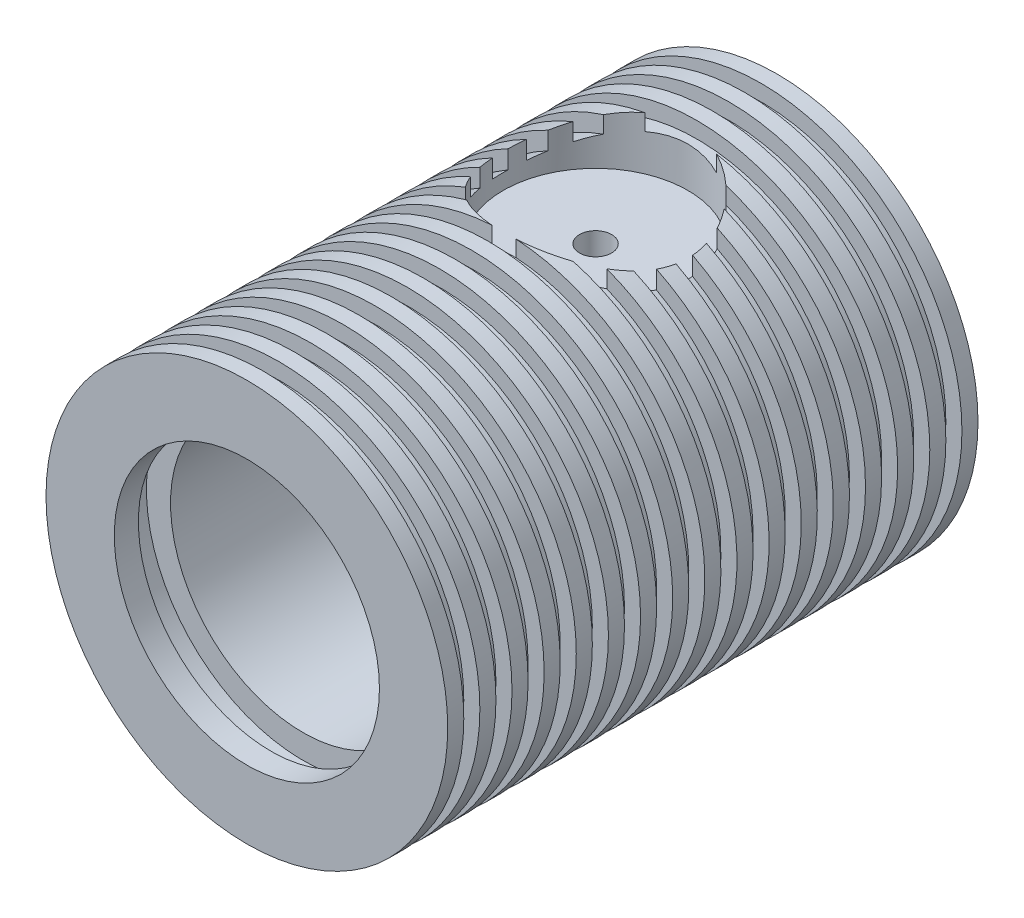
ISO-10303-21;
HEADER;
FILE_DESCRIPTION(('STEP AP214'),'2;1');
FILE_NAME('part.step','',(''),(''),'','','');
FILE_SCHEMA(('AUTOMOTIVE_DESIGN { 1 0 10303 214 1 1 1 1 }'));
ENDSEC;
DATA;
#1=APPLICATION_CONTEXT('core data for automotive mechanical design processes');
#2=APPLICATION_PROTOCOL_DEFINITION('international standard','automotive_design',2000,#1);
#3=PRODUCT_CONTEXT('',#1,'mechanical');
#4=PRODUCT('Part','Part','',(#3));
#5=PRODUCT_RELATED_PRODUCT_CATEGORY('part','',(#4));
#6=PRODUCT_DEFINITION_FORMATION('','',#4);
#7=PRODUCT_DEFINITION_CONTEXT('part definition',#1,'design');
#8=PRODUCT_DEFINITION('design','',#6,#7);
#9=PRODUCT_DEFINITION_SHAPE('','',#8);
#10=(LENGTH_UNIT() NAMED_UNIT(*) SI_UNIT(.MILLI.,.METRE.));
#11=(NAMED_UNIT(*) PLANE_ANGLE_UNIT() SI_UNIT($,.RADIAN.));
#12=(NAMED_UNIT(*) SI_UNIT($,.STERADIAN.) SOLID_ANGLE_UNIT());
#13=UNCERTAINTY_MEASURE_WITH_UNIT(LENGTH_MEASURE(1.E-05),#10,'distance_accuracy_value','');
#14=(GEOMETRIC_REPRESENTATION_CONTEXT(3) GLOBAL_UNCERTAINTY_ASSIGNED_CONTEXT((#13)) GLOBAL_UNIT_ASSIGNED_CONTEXT((#10,
#11,#12)) REPRESENTATION_CONTEXT('',''));
#15=CARTESIAN_POINT('',(0.,0.,0.));
#16=DIRECTION('',(0.,0.,1.));
#17=DIRECTION('',(1.,0.,0.));
#18=AXIS2_PLACEMENT_3D('',#15,#16,#17);
#19=CARTESIAN_POINT('',(0.,0.,16.5));
#20=DIRECTION('',(0.,0.,-1.));
#21=DIRECTION('',(-1.,0.,0.));
#22=AXIS2_PLACEMENT_3D('',#19,#20,#21);
#23=CYLINDRICAL_SURFACE('',#22,12.5);
#24=CARTESIAN_POINT('',(0.,0.,-13.5));
#25=DIRECTION('',(0.,0.,1.));
#26=DIRECTION('',(1.,0.,0.));
#27=AXIS2_PLACEMENT_3D('',#24,#25,#26);
#28=CIRCLE('',#27,12.5);
#29=CARTESIAN_POINT('',(12.5,0.,-13.5));
#30=VERTEX_POINT('',#29);
#31=EDGE_CURVE('E790',#30,#30,#28,.T.);
#32=ORIENTED_EDGE('',*,*,#31,.F.);
#33=EDGE_LOOP('',(#32));
#34=FACE_BOUND('',#33,.T.);
#35=CARTESIAN_POINT('',(0.,0.,-14.5));
#36=DIRECTION('',(0.,0.,1.));
#37=DIRECTION('',(1.,0.,0.));
#38=AXIS2_PLACEMENT_3D('',#35,#36,#37);
#39=CIRCLE('',#38,12.5);
#40=CARTESIAN_POINT('',(12.5,0.,-14.5));
#41=VERTEX_POINT('',#40);
#42=EDGE_CURVE('E805',#41,#41,#39,.T.);
#43=ORIENTED_EDGE('',*,*,#42,.T.);
#44=EDGE_LOOP('',(#43));
#45=FACE_BOUND('',#44,.T.);
#46=ADVANCED_FACE('F34',(#34,#45),#23,.T.);
#47=CARTESIAN_POINT('',(0.,0.,-16.5));
#48=DIRECTION('',(0.,0.,1.));
#49=DIRECTION('',(1.,0.,0.));
#50=AXIS2_PLACEMENT_3D('',#47,#48,#49);
#51=CIRCLE('',#50,12.5);
#52=CARTESIAN_POINT('',(12.5,0.,-16.5));
#53=VERTEX_POINT('',#52);
#54=EDGE_CURVE('E250',#53,#53,#51,.T.);
#55=ORIENTED_EDGE('',*,*,#54,.T.);
#56=EDGE_LOOP('',(#55));
#57=FACE_BOUND('',#56,.T.);
#58=CARTESIAN_POINT('',(0.,0.,-15.5));
#59=DIRECTION('',(0.,0.,1.));
#60=DIRECTION('',(1.,0.,0.));
#61=AXIS2_PLACEMENT_3D('',#58,#59,#60);
#62=CIRCLE('',#61,12.5);
#63=CARTESIAN_POINT('',(12.5,0.,-15.5));
#64=VERTEX_POINT('',#63);
#65=EDGE_CURVE('E802',#64,#64,#62,.T.);
#66=ORIENTED_EDGE('',*,*,#65,.F.);
#67=EDGE_LOOP('',(#66));
#68=FACE_BOUND('',#67,.T.);
#69=ADVANCED_FACE('F601',(#57,#68),#23,.T.);
#70=CARTESIAN_POINT('',(0.,0.,-11.5));
#71=DIRECTION('',(0.,0.,1.));
#72=DIRECTION('',(1.,0.,0.));
#73=AXIS2_PLACEMENT_3D('',#70,#71,#72);
#74=CIRCLE('',#73,12.5);
#75=CARTESIAN_POINT('',(12.5,0.,-11.5));
#76=VERTEX_POINT('',#75);
#77=EDGE_CURVE('E210',#76,#76,#74,.T.);
#78=ORIENTED_EDGE('',*,*,#77,.F.);
#79=EDGE_LOOP('',(#78));
#80=FACE_BOUND('',#79,.T.);
#81=CARTESIAN_POINT('',(0.,0.,-12.5));
#82=DIRECTION('',(0.,0.,1.));
#83=DIRECTION('',(1.,0.,0.));
#84=AXIS2_PLACEMENT_3D('',#81,#82,#83);
#85=CIRCLE('',#84,12.5);
#86=CARTESIAN_POINT('',(12.5,0.,-12.5));
#87=VERTEX_POINT('',#86);
#88=EDGE_CURVE('E793',#87,#87,#85,.T.);
#89=ORIENTED_EDGE('',*,*,#88,.T.);
#90=EDGE_LOOP('',(#89));
#91=FACE_BOUND('',#90,.T.);
#92=ADVANCED_FACE('F606',(#80,#91),#23,.T.);
#93=CARTESIAN_POINT('',(0.,0.,-10.5));
#94=DIRECTION('',(0.,0.,1.));
#95=DIRECTION('',(1.,0.,0.));
#96=AXIS2_PLACEMENT_3D('',#93,#94,#95);
#97=CIRCLE('',#96,12.5);
#98=CARTESIAN_POINT('',(-2.22991031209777,12.2994918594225,-10.5));
#99=VERTEX_POINT('',#98);
#100=CARTESIAN_POINT('',(2.22991031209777,12.2994918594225,-10.5));
#101=VERTEX_POINT('',#100);
#102=EDGE_CURVE('E196',#99,#101,#97,.T.);
#103=ORIENTED_EDGE('',*,*,#102,.T.);
#104=CARTESIAN_POINT('',(0.,12.5,0.550000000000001));
#105=CARTESIAN_POINT('',(-0.152627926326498,12.4999990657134,0.549998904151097));
#106=CARTESIAN_POINT('',(-0.305287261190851,12.4971973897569,0.543915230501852));
#107=CARTESIAN_POINT('',(-0.609500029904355,12.4860602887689,0.519642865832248));
#108=CARTESIAN_POINT('',(-0.761052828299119,12.4777219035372,0.501447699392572));
#109=CARTESIAN_POINT('',(-1.06212404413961,12.4557099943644,0.453112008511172));
#110=CARTESIAN_POINT('',(-1.21163840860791,12.4420271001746,0.422950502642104));
#111=CARTESIAN_POINT('',(-1.50734650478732,12.4096754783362,0.350997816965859));
#112=CARTESIAN_POINT('',(-1.65353885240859,12.3910047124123,0.309201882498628));
#113=CARTESIAN_POINT('',(-1.94098724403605,12.3492334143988,0.214597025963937));
#114=CARTESIAN_POINT('',(-2.08226110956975,12.3261514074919,0.161834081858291));
#115=CARTESIAN_POINT('',(-2.35966803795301,12.2760693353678,0.0456757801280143));
#116=CARTESIAN_POINT('',(-2.49579914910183,12.2490678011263,-0.0177235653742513));
#117=CARTESIAN_POINT('',(-2.89513765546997,12.1631436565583,-0.22304392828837));
#118=CARTESIAN_POINT('',(-3.14963968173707,12.0992483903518,-0.380203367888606));
#119=CARTESIAN_POINT('',(-3.64274105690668,11.9603393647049,-0.740042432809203));
#120=CARTESIAN_POINT('',(-3.87975945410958,11.8849134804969,-0.944708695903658));
#121=CARTESIAN_POINT('',(-4.31763922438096,11.7329326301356,-1.38976870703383));
#122=CARTESIAN_POINT('',(-4.51847748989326,11.6563769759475,-1.63018511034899));
#123=CARTESIAN_POINT('',(-4.79467977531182,11.5443408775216,-2.02174674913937));
#124=CARTESIAN_POINT('',(-4.8847819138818,11.5064025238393,-2.16202385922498));
#125=CARTESIAN_POINT('',(-5.0527561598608,11.4336353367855,-2.45046051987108));
#126=CARTESIAN_POINT('',(-5.13063340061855,11.3988052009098,-2.59861672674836));
#127=CARTESIAN_POINT('',(-5.27347199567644,11.3334316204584,-2.90193525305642));
#128=CARTESIAN_POINT('',(-5.33843356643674,11.3028881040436,-3.05709745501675));
#129=CARTESIAN_POINT('',(-5.45472822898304,11.2472262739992,-3.37331081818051));
#130=CARTESIAN_POINT('',(-5.5060688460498,11.2221049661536,-3.53435867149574));
#131=CARTESIAN_POINT('',(-5.59211617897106,11.1794640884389,-3.85227546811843));
#132=CARTESIAN_POINT('',(-5.62757598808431,11.1616052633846,-4.00889497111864));
#133=CARTESIAN_POINT('',(-5.68531449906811,11.1323066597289,-4.32506804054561));
#134=CARTESIAN_POINT('',(-5.70759971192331,11.1208637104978,-4.48462011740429));
#135=CARTESIAN_POINT('',(-5.73869872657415,11.1048477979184,-4.80531138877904));
#136=CARTESIAN_POINT('',(-5.74751803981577,11.1002720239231,-4.96644990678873));
#137=CARTESIAN_POINT('',(-5.75157267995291,11.0981718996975,-5.2889381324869));
#138=CARTESIAN_POINT('',(-5.74680898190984,11.1006470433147,-5.4502878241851));
#139=CARTESIAN_POINT('',(-5.72489856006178,11.1119604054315,-5.75604467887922));
#140=CARTESIAN_POINT('',(-5.70900637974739,11.1201537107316,-5.90056781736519));
#141=CARTESIAN_POINT('',(-5.66640307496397,11.1419230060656,-6.18764417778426));
#142=CARTESIAN_POINT('',(-5.6396884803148,11.1555007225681,-6.33019675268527));
#143=CARTESIAN_POINT('',(-5.57572916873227,11.1876057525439,-6.61232305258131));
#144=CARTESIAN_POINT('',(-5.53848638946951,11.2061321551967,-6.75189732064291));
#145=CARTESIAN_POINT('',(-5.45383650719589,11.2475721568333,-7.02727970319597));
#146=CARTESIAN_POINT('',(-5.40642544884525,11.2704874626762,-7.16308632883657));
#147=CARTESIAN_POINT('',(-5.24717240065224,11.3459792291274,-7.56971356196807));
#148=CARTESIAN_POINT('',(-5.11973165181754,11.4045498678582,-7.83350213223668));
#149=CARTESIAN_POINT('',(-4.82771080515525,11.5311949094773,-8.33697347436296));
#150=CARTESIAN_POINT('',(-4.66311463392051,11.5992734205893,-8.5766457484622));
#151=CARTESIAN_POINT('',(-4.28120549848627,11.7459520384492,-9.05177452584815));
#152=CARTESIAN_POINT('',(-4.06016928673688,11.8249057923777,-9.28413798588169));
#153=CARTESIAN_POINT('',(-3.58151477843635,11.9785532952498,-9.70973567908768));
#154=CARTESIAN_POINT('',(-3.32388387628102,12.0532455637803,-9.90295637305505));
#155=CARTESIAN_POINT('',(-2.90984906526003,12.1574707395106,-10.1621656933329));
#156=CARTESIAN_POINT('',(-2.76458509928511,12.1914035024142,-10.2445592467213));
#157=CARTESIAN_POINT('',(-2.46673246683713,12.2551364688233,-10.3966963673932));
#158=CARTESIAN_POINT('',(-2.31414687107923,12.2849383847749,-10.4664451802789));
#159=CARTESIAN_POINT('',(-2.00273837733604,12.3395311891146,-10.5925651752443));
#160=CARTESIAN_POINT('',(-1.84391748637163,12.3643236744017,-10.6489406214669));
#161=CARTESIAN_POINT('',(-1.52120818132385,12.4081596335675,-10.747692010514));
#162=CARTESIAN_POINT('',(-1.35732025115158,12.4272036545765,-10.7900692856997));
#163=CARTESIAN_POINT('',(-1.0380717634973,12.4577766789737,-10.8576972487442));
#164=CARTESIAN_POINT('',(-0.882972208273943,12.469755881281,-10.8839794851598));
#165=CARTESIAN_POINT('',(-0.570810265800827,12.4879386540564,-10.9237598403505));
#166=CARTESIAN_POINT('',(-0.413748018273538,12.4941426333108,-10.9372588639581));
#167=CARTESIAN_POINT('',(-0.0989720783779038,12.500599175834,-10.9513058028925));
#168=CARTESIAN_POINT('',(0.0587413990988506,12.5008535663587,-10.9518576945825));
#169=CARTESIAN_POINT('',(0.373574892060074,12.4954082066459,-10.9400134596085));
#170=CARTESIAN_POINT('',(0.530694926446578,12.4897086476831,-10.9276177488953));
#171=CARTESIAN_POINT('',(0.833146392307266,12.473064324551,-10.891227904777));
#172=CARTESIAN_POINT('',(0.978592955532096,12.4624755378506,-10.868020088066));
#173=CARTESIAN_POINT('',(1.26690830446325,12.4364747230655,-10.8106200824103));
#174=CARTESIAN_POINT('',(1.40977624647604,12.4210611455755,-10.7764243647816));
#175=CARTESIAN_POINT('',(1.69193106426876,12.3857808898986,-10.6973921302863));
#176=CARTESIAN_POINT('',(1.8312189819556,12.3659155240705,-10.6525587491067));
#177=CARTESIAN_POINT('',(2.1054473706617,12.322192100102,-10.552655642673));
#178=CARTESIAN_POINT('',(2.24038615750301,12.2983325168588,-10.497582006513));
#179=CARTESIAN_POINT('',(2.64559115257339,12.2199750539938,-10.313989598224));
#180=CARTESIAN_POINT('',(2.90773162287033,12.1598033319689,-10.169486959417));
#181=CARTESIAN_POINT('',(3.40484394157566,12.0300993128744,-9.84307721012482));
#182=CARTESIAN_POINT('',(3.63980378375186,11.9605629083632,-9.66115366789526));
#183=CARTESIAN_POINT('',(4.0973042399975,11.8120587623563,-9.24694840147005));
#184=CARTESIAN_POINT('',(4.31705673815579,11.7327933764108,-9.01168779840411));
#185=CARTESIAN_POINT('',(4.71505445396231,11.5785979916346,-8.50666645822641));
#186=CARTESIAN_POINT('',(4.89328146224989,11.5036699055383,-8.23689066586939));
#187=CARTESIAN_POINT('',(5.12787294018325,11.4001109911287,-7.80676922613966));
#188=CARTESIAN_POINT('',(5.20143963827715,11.3666393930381,-7.65674123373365));
#189=CARTESIAN_POINT('',(5.33551433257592,11.3043244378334,-7.35005820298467));
#190=CARTESIAN_POINT('',(5.39602815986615,11.2754790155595,-7.1934061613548));
#191=CARTESIAN_POINT('',(5.50329913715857,11.2235135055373,-6.8746538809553));
#192=CARTESIAN_POINT('',(5.55006524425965,11.200389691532,-6.71255726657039));
#193=CARTESIAN_POINT('',(5.62929009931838,11.1607823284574,-6.3841099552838));
#194=CARTESIAN_POINT('',(5.66175062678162,11.1442979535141,-6.21775979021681));
#195=CARTESIAN_POINT('',(5.70967150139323,11.1198159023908,-5.89716983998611));
#196=CARTESIAN_POINT('',(5.72638379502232,11.1111954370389,-5.74316375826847));
#197=CARTESIAN_POINT('',(5.74732031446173,11.1003806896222,-5.43408395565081));
#198=CARTESIAN_POINT('',(5.75154546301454,11.0981859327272,-5.27901031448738));
#199=CARTESIAN_POINT('',(5.7474515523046,11.1003065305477,-4.9691093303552));
#200=CARTESIAN_POINT('',(5.73913522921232,11.1046204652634,-4.81428194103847));
#201=CARTESIAN_POINT('',(5.71007676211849,11.1195903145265,-4.50611406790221));
#202=CARTESIAN_POINT('',(5.68933488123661,11.130246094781,-4.35277355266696));
#203=CARTESIAN_POINT('',(5.63754838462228,11.1565598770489,-4.05930543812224));
#204=CARTESIAN_POINT('',(5.60731636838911,11.1718205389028,-3.91899799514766));
#205=CARTESIAN_POINT('',(5.53663294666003,11.2070175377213,-3.64156655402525));
#206=CARTESIAN_POINT('',(5.49617830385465,11.2269553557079,-3.5044435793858));
#207=CARTESIAN_POINT('',(5.36002267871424,11.2929364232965,-3.09910119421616));
#208=CARTESIAN_POINT('',(5.24949502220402,11.3451660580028,-2.83671305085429));
#209=CARTESIAN_POINT('',(4.9838895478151,11.4644352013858,-2.31655457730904));
#210=CARTESIAN_POINT('',(4.82636182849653,11.5322222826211,-2.06022029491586));
#211=CARTESIAN_POINT('',(4.47428716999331,11.6733358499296,-1.5760582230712));
#212=CARTESIAN_POINT('',(4.27972345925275,11.7466648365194,-1.34824342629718));
#213=CARTESIAN_POINT('',(3.83678850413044,11.8991096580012,-0.904792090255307));
#214=CARTESIAN_POINT('',(3.58503856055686,11.9781020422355,-0.69244566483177));
#215=CARTESIAN_POINT('',(3.18176925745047,12.0890836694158,-0.407708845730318));
#216=CARTESIAN_POINT('',(3.0429474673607,12.1248526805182,-0.318367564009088));
#217=CARTESIAN_POINT('',(2.75751736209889,12.1929310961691,-0.151647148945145));
#218=CARTESIAN_POINT('',(2.61091268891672,12.2252420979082,-0.074262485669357));
#219=CARTESIAN_POINT('',(2.31184481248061,12.2852956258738,0.0673592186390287));
#220=CARTESIAN_POINT('',(2.15942789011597,12.313067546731,0.131681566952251));
#221=CARTESIAN_POINT('',(1.84893166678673,12.3635013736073,0.247142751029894));
#222=CARTESIAN_POINT('',(1.69085515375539,12.386165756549,0.298287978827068));
#223=CARTESIAN_POINT('',(1.37057164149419,12.4256795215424,0.386731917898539));
#224=CARTESIAN_POINT('',(1.20837526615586,12.4425424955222,0.424063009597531));
#225=CARTESIAN_POINT('',(0.880920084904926,12.4700014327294,0.484555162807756));
#226=CARTESIAN_POINT('',(0.715663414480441,12.4806016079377,0.507725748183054));
#227=CARTESIAN_POINT('',(0.458341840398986,12.4919289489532,0.53243759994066));
#228=CARTESIAN_POINT('',(0.366830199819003,12.4949525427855,0.539020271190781));
#229=CARTESIAN_POINT('',(0.183549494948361,12.4989883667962,0.547801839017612));
#230=CARTESIAN_POINT('',(0.0917804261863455,12.5000005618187,0.550000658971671));
#231=CARTESIAN_POINT('',(0.,12.5,0.550000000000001));
#232=B_SPLINE_CURVE_WITH_KNOTS('',3,(#104,#105,#106,#107,#108,#109,#110,#111,#112,#113,#114,
#115,#116,#117,#118,#119,#120,#121,#122,#123,#124,#125,#126,#127,#128,#129,#130,#131,#132,#133,
#134,#135,#136,#137,#138,#139,#140,#141,#142,#143,#144,#145,#146,#147,#148,#149,#150,#151,#152,
#153,#154,#155,#156,#157,#158,#159,#160,#161,#162,#163,#164,#165,#166,#167,#168,#169,#170,#171,
#172,#173,#174,#175,#176,#177,#178,#179,#180,#181,#182,#183,#184,#185,#186,#187,#188,#189,#190,
#191,#192,#193,#194,#195,#196,#197,#198,#199,#200,#201,#202,#203,#204,#205,#206,#207,#208,#209,
#210,#211,#212,#213,#214,#215,#216,#217,#218,#219,#220,#221,#222,#223,#224,#225,#226,#227,#228,
#229,#230,#231),.UNSPECIFIED.,.T.,.F.,(4,2,2,2,2,2,2,2,2,2,2,2,2,2,2,2,2,2,2,2,2,2,2,2,2,2,2,2,
2,2,2,2,2,2,2,2,2,2,2,2,2,2,2,2,2,2,2,2,2,2,2,2,2,2,2,2,2,2,2,2,2,2,2,4),(0.,0.457792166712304,
0.915829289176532,1.37467309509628,1.83370469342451,2.29084932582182,2.74816573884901,
3.6616953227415,4.62413494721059,5.58718710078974,6.09960130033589,6.61179975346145,
7.12398962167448,7.63589592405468,8.11994783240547,8.60376031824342,9.08737473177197,
9.57095442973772,10.007315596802,10.4438167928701,10.8802377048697,11.316828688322,
12.2091210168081,13.1018000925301,14.0883413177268,15.0752232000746,15.5859085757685,
16.0963816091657,16.6066916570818,17.1169531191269,17.5896317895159,18.0622769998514,
18.5347770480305,19.0072619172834,19.4497499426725,19.8923802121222,20.3348801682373,
20.7775494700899,21.6893177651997,22.6014872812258,23.5917973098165,24.5825407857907,
25.0932082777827,25.6036471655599,26.113752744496,26.6237948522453,27.0886225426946,
27.5534158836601,28.0181078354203,28.4827899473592,28.9153045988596,29.3479563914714,
30.2126690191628,31.1341946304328,32.0561385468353,33.066942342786,33.5731767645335,
34.0791763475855,34.5817568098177,35.0840930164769,35.5852441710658,36.0860578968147,
36.3613392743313,36.6366254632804),.UNSPECIFIED.);
#233=CARTESIAN_POINT('',(3.81739439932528,11.9028357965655,-9.5));
#234=VERTEX_POINT('',#233);
#235=EDGE_CURVE('E206',#101,#234,#232,.T.);
#236=ORIENTED_EDGE('',*,*,#235,.T.);
#237=CARTESIAN_POINT('',(0.,0.,-9.5));
#238=DIRECTION('',(0.,0.,1.));
#239=DIRECTION('',(1.,0.,0.));
#240=AXIS2_PLACEMENT_3D('',#237,#238,#239);
#241=CIRCLE('',#240,12.5);
#242=CARTESIAN_POINT('',(-3.81739439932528,11.9028357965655,-9.5));
#243=VERTEX_POINT('',#242);
#244=EDGE_CURVE('E774',#243,#234,#241,.T.);
#245=ORIENTED_EDGE('',*,*,#244,.F.);
#246=EDGE_CURVE('E209',#243,#99,#232,.T.);
#247=ORIENTED_EDGE('',*,*,#246,.T.);
#248=EDGE_LOOP('',(#103,#236,#245,#247));
#249=FACE_BOUND('',#248,.T.);
#250=ADVANCED_FACE('F204',(#249),#23,.T.);
#251=CARTESIAN_POINT('',(0.,9.,-5.2));
#252=DIRECTION('',(0.,1.,0.));
#253=DIRECTION('',(0.,0.,1.));
#254=AXIS2_PLACEMENT_3D('',#251,#252,#253);
#255=CYLINDRICAL_SURFACE('',#254,5.75);
#256=CARTESIAN_POINT('',(0.,9.,-5.2));
#257=DIRECTION('',(0.,1.,0.));
#258=DIRECTION('',(0.,0.,1.));
#259=AXIS2_PLACEMENT_3D('',#256,#257,#258);
#260=CIRCLE('',#259,5.75);
#261=CARTESIAN_POINT('',(0.,9.,0.550000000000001));
#262=VERTEX_POINT('',#261);
#263=EDGE_CURVE('E314',#262,#262,#260,.T.);
#264=ORIENTED_EDGE('',*,*,#263,.F.);
#265=EDGE_LOOP('',(#264));
#266=FACE_BOUND('',#265,.T.);
#267=DIRECTION('',(0.,1.,0.));
#268=VECTOR('',#267,1.);
#269=CARTESIAN_POINT('',(-2.22991031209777,9.,-10.5));
#270=LINE('',#269,#268);
#271=CARTESIAN_POINT('',(-2.22991031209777,11.2817330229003,-10.5));
#272=VERTEX_POINT('',#271);
#273=EDGE_CURVE('E11',#99,#272,#270,.F.);
#274=ORIENTED_EDGE('',*,*,#273,.F.);
#275=ORIENTED_EDGE('',*,*,#246,.F.);
#276=DIRECTION('',(0.,1.,0.));
#277=VECTOR('',#276,1.);
#278=CARTESIAN_POINT('',(-3.81739439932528,9.,-9.5));
#279=LINE('',#278,#277);
#280=CARTESIAN_POINT('',(-3.81739439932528,10.8479260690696,-9.5));
#281=VERTEX_POINT('',#280);
#282=EDGE_CURVE('E933',#281,#243,#279,.T.);
#283=ORIENTED_EDGE('',*,*,#282,.F.);
#284=CARTESIAN_POINT('',(-4.7087684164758,10.4917824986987,-8.5));
#285=CARTESIAN_POINT('',(-4.64432981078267,10.5207038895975,-8.59194685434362));
#286=CARTESIAN_POINT('',(-4.57726901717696,10.5500869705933,-8.68190621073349));
#287=CARTESIAN_POINT('',(-4.43831653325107,10.609289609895,-8.85736667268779));
#288=CARTESIAN_POINT('',(-4.36644085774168,10.6391074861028,-8.94288102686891));
#289=CARTESIAN_POINT('',(-4.21786065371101,10.6988813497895,-9.10955437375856));
#290=CARTESIAN_POINT('',(-4.14115614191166,10.7288373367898,-9.19071338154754));
#291=CARTESIAN_POINT('',(-3.98285550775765,10.7886075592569,-9.34872362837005));
#292=CARTESIAN_POINT('',(-3.90124458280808,10.8184210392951,-9.42556032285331));
#293=CARTESIAN_POINT('',(-3.81739439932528,10.8479260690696,-9.5));
#294=B_SPLINE_CURVE_WITH_KNOTS('',3,(#284,#285,#286,#287,#288,#289,#290,#291,#292,#293),
.UNSPECIFIED.,.F.,.F.,(4,2,2,2,4),(0.,0.347779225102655,0.694454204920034,1.04112798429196,
1.3889059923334),.UNSPECIFIED.);
#295=CARTESIAN_POINT('',(-4.7087684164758,10.4917824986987,-8.5));
#296=VERTEX_POINT('',#295);
#297=EDGE_CURVE('E521',#296,#281,#294,.T.);
#298=ORIENTED_EDGE('',*,*,#297,.F.);
#299=DIRECTION('',(0.,1.,0.));
#300=VECTOR('',#299,1.);
#301=CARTESIAN_POINT('',(-4.7087684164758,9.,-8.5));
#302=LINE('',#301,#300);
#303=CARTESIAN_POINT('',(-4.7087684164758,11.5791839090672,-8.5));
#304=VERTEX_POINT('',#303);
#305=EDGE_CURVE('E931',#304,#296,#302,.F.);
#306=ORIENTED_EDGE('',*,*,#305,.F.);
#307=CARTESIAN_POINT('',(-5.26996204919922,11.3347915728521,-7.5));
#308=VERTEX_POINT('',#307);
#309=EDGE_CURVE('E220',#308,#304,#232,.T.);
#310=ORIENTED_EDGE('',*,*,#309,.F.);
#311=DIRECTION('',(0.,1.,0.));
#312=VECTOR('',#311,1.);
#313=CARTESIAN_POINT('',(-5.26996204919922,9.,-7.5));
#314=LINE('',#313,#312);
#315=CARTESIAN_POINT('',(-5.26996204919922,10.2214235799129,-7.5));
#316=VERTEX_POINT('',#315);
#317=EDGE_CURVE('E862',#316,#308,#314,.T.);
#318=ORIENTED_EDGE('',*,*,#317,.F.);
#319=CARTESIAN_POINT('',(-5.60111596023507,10.0437791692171,-6.5));
#320=CARTESIAN_POINT('',(-5.5810913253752,10.0549443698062,-6.58628576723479));
#321=CARTESIAN_POINT('',(-5.55909937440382,10.0671320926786,-6.67197756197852));
#322=CARTESIAN_POINT('',(-5.51133354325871,10.0933618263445,-6.84178464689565));
#323=CARTESIAN_POINT('',(-5.48556894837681,10.1073992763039,-6.92590325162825));
#324=CARTESIAN_POINT('',(-5.43031331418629,10.1371929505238,-7.09259290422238));
#325=CARTESIAN_POINT('',(-5.40082236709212,10.1529491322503,-7.17516399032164));
#326=CARTESIAN_POINT('',(-5.33813799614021,10.1860461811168,-7.33880372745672));
#327=CARTESIAN_POINT('',(-5.30493575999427,10.2033908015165,-7.41986824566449));
#328=CARTESIAN_POINT('',(-5.26996204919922,10.2214235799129,-7.5));
#329=B_SPLINE_CURVE_WITH_KNOTS('',3,(#319,#320,#321,#322,#323,#324,#325,#326,#327,#328),
.UNSPECIFIED.,.F.,.F.,(4,2,2,2,4),(0.,0.267802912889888,0.53495745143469,0.802105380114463,
1.06990168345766),.UNSPECIFIED.);
#330=CARTESIAN_POINT('',(-5.60111596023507,10.0437791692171,-6.5));
#331=VERTEX_POINT('',#330);
#332=EDGE_CURVE('E505',#331,#316,#329,.T.);
#333=ORIENTED_EDGE('',*,*,#332,.F.);
#334=DIRECTION('',(0.,1.,0.));
#335=VECTOR('',#334,1.);
#336=CARTESIAN_POINT('',(-5.60111596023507,9.,-6.5));
#337=LINE('',#336,#335);
#338=CARTESIAN_POINT('',(-5.60111596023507,11.1748601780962,-6.5));
#339=VERTEX_POINT('',#338);
#340=EDGE_CURVE('E857',#339,#331,#337,.F.);
#341=ORIENTED_EDGE('',*,*,#340,.F.);
#342=CARTESIAN_POINT('',(-5.7421685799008,11.1030401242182,-5.5));
#343=VERTEX_POINT('',#342);
#344=EDGE_CURVE('E243',#343,#339,#232,.T.);
#345=ORIENTED_EDGE('',*,*,#344,.F.);
#346=DIRECTION('',(0.,1.,0.));
#347=VECTOR('',#346,1.);
#348=CARTESIAN_POINT('',(-5.7421685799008,9.,-5.5));
#349=LINE('',#348,#347);
#350=CARTESIAN_POINT('',(-5.7421685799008,9.96380951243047,-5.5));
#351=VERTEX_POINT('',#350);
#352=EDGE_CURVE('E874',#351,#343,#349,.T.);
#353=ORIENTED_EDGE('',*,*,#352,.F.);
#354=CARTESIAN_POINT('',(-5.70723225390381,9.98386197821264,-4.5));
#355=CARTESIAN_POINT('',(-5.71739555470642,9.97804699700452,-4.58282626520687));
#356=CARTESIAN_POINT('',(-5.72575594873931,9.97325107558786,-4.66593969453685));
#357=CARTESIAN_POINT('',(-5.73883701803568,9.96573355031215,-4.83233515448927));
#358=CARTESIAN_POINT('',(-5.74356678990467,9.96300676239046,-4.91561623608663));
#359=CARTESIAN_POINT('',(-5.75232807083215,9.95794474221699,-5.1658892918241));
#360=CARTESIAN_POINT('',(-5.75091228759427,9.95873893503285,-5.33315384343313));
#361=CARTESIAN_POINT('',(-5.7421685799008,9.96380951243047,-5.5));
#362=B_SPLINE_CURVE_WITH_KNOTS('',3,(#354,#355,#356,#357,#358,#359,#360,#361),.UNSPECIFIED.,.F.,
.F.,(4,2,2,4),(0.,0.25091211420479,0.501193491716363,1.00223032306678),.UNSPECIFIED.);
#363=CARTESIAN_POINT('',(-5.70723225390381,9.98386197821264,-4.5));
#364=VERTEX_POINT('',#363);
#365=EDGE_CURVE('E488',#364,#351,#362,.T.);
#366=ORIENTED_EDGE('',*,*,#365,.F.);
#367=DIRECTION('',(0.,1.,0.));
#368=VECTOR('',#367,1.);
#369=CARTESIAN_POINT('',(-5.70723225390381,9.,-4.5));
#370=LINE('',#369,#368);
#371=CARTESIAN_POINT('',(-5.70723225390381,11.1210386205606,-4.5));
#372=VERTEX_POINT('',#371);
#373=EDGE_CURVE('E870',#372,#364,#370,.F.);
#374=ORIENTED_EDGE('',*,*,#373,.F.);
#375=CARTESIAN_POINT('',(-5.49295002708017,11.2284237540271,-3.5));
#376=VERTEX_POINT('',#375);
#377=EDGE_CURVE('E236',#376,#372,#232,.T.);
#378=ORIENTED_EDGE('',*,*,#377,.F.);
#379=DIRECTION('',(0.,1.,0.));
#380=VECTOR('',#379,1.);
#381=CARTESIAN_POINT('',(-5.49295002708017,9.,-3.5));
#382=LINE('',#381,#380);
#383=CARTESIAN_POINT('',(-5.49295002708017,10.1033410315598,-3.5));
#384=VERTEX_POINT('',#383);
#385=EDGE_CURVE('E887',#384,#376,#382,.T.);
#386=ORIENTED_EDGE('',*,*,#385,.F.);
#387=CARTESIAN_POINT('',(-5.07666228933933,10.3187935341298,-2.5));
#388=CARTESIAN_POINT('',(-5.1188873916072,10.298018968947,-2.57939184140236));
#389=CARTESIAN_POINT('',(-5.15931196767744,10.2778094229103,-2.65989405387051));
#390=CARTESIAN_POINT('',(-5.23635406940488,10.2387723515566,-2.82277661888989));
#391=CARTESIAN_POINT('',(-5.27298057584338,10.219941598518,-2.90515195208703));
#392=CARTESIAN_POINT('',(-5.34242696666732,10.1838110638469,-3.07182615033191));
#393=CARTESIAN_POINT('',(-5.37524675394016,10.1665113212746,-3.1561250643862));
#394=CARTESIAN_POINT('',(-5.43704236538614,10.1335971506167,-3.32668154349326));
#395=CARTESIAN_POINT('',(-5.46600866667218,10.1179869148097,-3.4129433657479));
#396=CARTESIAN_POINT('',(-5.49295002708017,10.1033410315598,-3.5));
#397=B_SPLINE_CURVE_WITH_KNOTS('',3,(#387,#388,#389,#390,#391,#392,#393,#394,#395,#396),
.UNSPECIFIED.,.F.,.F.,(4,2,2,2,4),(0.,0.276852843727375,0.553035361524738,0.829224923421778,
1.10608481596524),.UNSPECIFIED.);
#398=CARTESIAN_POINT('',(-5.07666228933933,10.3187935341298,-2.5));
#399=VERTEX_POINT('',#398);
#400=EDGE_CURVE('E471',#399,#384,#397,.T.);
#401=ORIENTED_EDGE('',*,*,#400,.F.);
#402=DIRECTION('',(0.,1.,0.));
#403=VECTOR('',#402,1.);
#404=CARTESIAN_POINT('',(-5.07666228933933,9.,-2.5));
#405=LINE('',#404,#403);
#406=CARTESIAN_POINT('',(-5.07666228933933,11.4226748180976,-2.5));
#407=VERTEX_POINT('',#406);
#408=EDGE_CURVE('E883',#407,#399,#405,.F.);
#409=ORIENTED_EDGE('',*,*,#408,.F.);
#410=CARTESIAN_POINT('',(-4.40142022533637,11.6994657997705,-1.5));
#411=VERTEX_POINT('',#410);
#412=EDGE_CURVE('E229',#411,#407,#232,.T.);
#413=ORIENTED_EDGE('',*,*,#412,.F.);
#414=DIRECTION('',(0.,1.,0.));
#415=VECTOR('',#414,1.);
#416=CARTESIAN_POINT('',(-4.40142022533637,9.,-1.5));
#417=LINE('',#416,#415);
#418=CARTESIAN_POINT('',(-4.40142022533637,10.6243823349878,-1.5));
#419=VERTEX_POINT('',#418);
#420=EDGE_CURVE('E900',#419,#411,#417,.T.);
#421=ORIENTED_EDGE('',*,*,#420,.F.);
#422=CARTESIAN_POINT('',(-3.31247641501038,11.0126064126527,-0.5));
#423=CARTESIAN_POINT('',(-3.41405300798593,10.9820570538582,-0.571588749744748));
#424=CARTESIAN_POINT('',(-3.5131423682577,10.9507157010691,-0.646354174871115));
#425=CARTESIAN_POINT('',(-3.70569595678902,10.8870583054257,-0.801641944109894));
#426=CARTESIAN_POINT('',(-3.79918059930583,10.8547465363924,-0.882140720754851));
#427=CARTESIAN_POINT('',(-3.98066856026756,10.7895124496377,-1.04886010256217));
#428=CARTESIAN_POINT('',(-4.06867195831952,10.7565901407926,-1.13508062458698));
#429=CARTESIAN_POINT('',(-4.23927793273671,10.6905068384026,-1.3133177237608));
#430=CARTESIAN_POINT('',(-4.32185803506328,10.6573454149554,-1.40535565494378));
#431=CARTESIAN_POINT('',(-4.40142022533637,10.6243823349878,-1.5));
#432=B_SPLINE_CURVE_WITH_KNOTS('',3,(#422,#423,#424,#425,#426,#427,#428,#429,#430,#431),
.UNSPECIFIED.,.F.,.F.,(4,2,2,2,4),(0.,0.383828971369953,0.766162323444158,1.14849012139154,
1.53231353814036),.UNSPECIFIED.);
#433=CARTESIAN_POINT('',(-3.31247641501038,11.0126064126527,-0.5));
#434=VERTEX_POINT('',#433);
#435=EDGE_CURVE('E455',#434,#419,#432,.T.);
#436=ORIENTED_EDGE('',*,*,#435,.F.);
#437=DIRECTION('',(0.,1.,0.));
#438=VECTOR('',#437,1.);
#439=CARTESIAN_POINT('',(-3.31247641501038,9.,-0.5));
#440=LINE('',#439,#438);
#441=CARTESIAN_POINT('',(-3.31247641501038,12.0531116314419,-0.5));
#442=VERTEX_POINT('',#441);
#443=EDGE_CURVE('E896',#442,#434,#440,.F.);
#444=ORIENTED_EDGE('',*,*,#443,.F.);
#445=CARTESIAN_POINT('',(-0.756637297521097,12.477078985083,0.499999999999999));
#446=VERTEX_POINT('',#445);
#447=EDGE_CURVE('E219',#446,#442,#232,.T.);
#448=ORIENTED_EDGE('',*,*,#447,.F.);
#449=DIRECTION('',(0.,1.,0.));
#450=VECTOR('',#449,1.);
#451=CARTESIAN_POINT('',(-0.756637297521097,9.,0.499999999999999));
#452=LINE('',#451,#450);
#453=CARTESIAN_POINT('',(-0.756637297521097,11.4750816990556,0.499999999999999));
#454=VERTEX_POINT('',#453);
#455=EDGE_CURVE('E228',#454,#446,#452,.T.);
#456=ORIENTED_EDGE('',*,*,#455,.F.);
#457=CARTESIAN_POINT('',(0.756637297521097,11.4750816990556,0.499999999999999));
#458=CARTESIAN_POINT('',(0.631105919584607,11.4833717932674,0.516675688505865));
#459=CARTESIAN_POINT('',(0.504885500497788,11.4896127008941,0.529198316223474));
#460=CARTESIAN_POINT('',(0.252440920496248,11.4979156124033,0.545837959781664));
#461=CARTESIAN_POINT('',(0.126220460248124,11.5,0.550000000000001));
#462=CARTESIAN_POINT('',(-0.126220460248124,11.5,0.550000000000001));
#463=CARTESIAN_POINT('',(-0.252440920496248,11.4979156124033,0.545837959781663));
#464=CARTESIAN_POINT('',(-0.504885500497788,11.4896127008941,0.529198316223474));
#465=CARTESIAN_POINT('',(-0.631105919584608,11.4833717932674,0.516675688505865));
#466=CARTESIAN_POINT('',(-0.756637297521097,11.4750816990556,0.499999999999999));
#467=B_SPLINE_CURVE_WITH_KNOTS('',3,(#457,#458,#459,#460,#461,#462,#463,#464,#465,#466),
.UNSPECIFIED.,.F.,.F.,(4,2,2,2,4),(0.,0.380633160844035,0.759210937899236,1.13778871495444,
1.51842187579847),.UNSPECIFIED.);
#468=CARTESIAN_POINT('',(0.756637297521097,11.4750816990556,0.499999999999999));
#469=VERTEX_POINT('',#468);
#470=EDGE_CURVE('E234',#469,#454,#467,.T.);
#471=ORIENTED_EDGE('',*,*,#470,.F.);
#472=DIRECTION('',(0.,1.,0.));
#473=VECTOR('',#472,1.);
#474=CARTESIAN_POINT('',(0.756637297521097,9.,0.499999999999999));
#475=LINE('',#474,#473);
#476=CARTESIAN_POINT('',(0.756637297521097,12.477078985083,0.499999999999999));
#477=VERTEX_POINT('',#476);
#478=EDGE_CURVE('E438',#477,#469,#475,.F.);
#479=ORIENTED_EDGE('',*,*,#478,.F.);
#480=CARTESIAN_POINT('',(3.31247641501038,12.0531116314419,-0.5));
#481=VERTEX_POINT('',#480);
#482=EDGE_CURVE('E237',#481,#477,#232,.T.);
#483=ORIENTED_EDGE('',*,*,#482,.F.);
#484=DIRECTION('',(0.,1.,0.));
#485=VECTOR('',#484,1.);
#486=CARTESIAN_POINT('',(3.31247641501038,9.,-0.5));
#487=LINE('',#486,#485);
#488=CARTESIAN_POINT('',(3.31247641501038,11.0126064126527,-0.5));
#489=VERTEX_POINT('',#488);
#490=EDGE_CURVE('E890',#489,#481,#487,.T.);
#491=ORIENTED_EDGE('',*,*,#490,.F.);
#492=CARTESIAN_POINT('',(4.40142022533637,10.6243823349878,-1.5));
#493=CARTESIAN_POINT('',(4.32185803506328,10.6573454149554,-1.40535565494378));
#494=CARTESIAN_POINT('',(4.23927793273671,10.6905068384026,-1.3133177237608));
#495=CARTESIAN_POINT('',(4.06867195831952,10.7565901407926,-1.13508062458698));
#496=CARTESIAN_POINT('',(3.98066856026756,10.7895124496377,-1.04886010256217));
#497=CARTESIAN_POINT('',(3.79918059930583,10.8547465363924,-0.882140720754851));
#498=CARTESIAN_POINT('',(3.70569595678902,10.8870583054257,-0.801641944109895));
#499=CARTESIAN_POINT('',(3.5131423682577,10.9507157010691,-0.646354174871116));
#500=CARTESIAN_POINT('',(3.41405300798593,10.9820570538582,-0.571588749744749));
#501=CARTESIAN_POINT('',(3.31247641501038,11.0126064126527,-0.500000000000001));
#502=B_SPLINE_CURVE_WITH_KNOTS('',3,(#492,#493,#494,#495,#496,#497,#498,#499,#500,#501),
.UNSPECIFIED.,.F.,.F.,(4,2,2,2,4),(0.,0.383823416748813,0.766151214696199,1.1484845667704,
1.53231353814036),.UNSPECIFIED.);
#503=CARTESIAN_POINT('',(4.40142022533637,10.6243823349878,-1.5));
#504=VERTEX_POINT('',#503);
#505=EDGE_CURVE('E463',#504,#489,#502,.T.);
#506=ORIENTED_EDGE('',*,*,#505,.F.);
#507=DIRECTION('',(0.,1.,0.));
#508=VECTOR('',#507,1.);
#509=CARTESIAN_POINT('',(4.40142022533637,9.,-1.5));
#510=LINE('',#509,#508);
#511=CARTESIAN_POINT('',(4.40142022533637,11.6994657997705,-1.5));
#512=VERTEX_POINT('',#511);
#513=EDGE_CURVE('E893',#512,#504,#510,.F.);
#514=ORIENTED_EDGE('',*,*,#513,.F.);
#515=CARTESIAN_POINT('',(5.07666228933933,11.4226748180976,-2.5));
#516=VERTEX_POINT('',#515);
#517=EDGE_CURVE('E244',#516,#512,#232,.T.);
#518=ORIENTED_EDGE('',*,*,#517,.F.);
#519=DIRECTION('',(0.,1.,0.));
#520=VECTOR('',#519,1.);
#521=CARTESIAN_POINT('',(5.07666228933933,9.,-2.5));
#522=LINE('',#521,#520);
#523=CARTESIAN_POINT('',(5.07666228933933,10.3187935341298,-2.5));
#524=VERTEX_POINT('',#523);
#525=EDGE_CURVE('E877',#524,#516,#522,.T.);
#526=ORIENTED_EDGE('',*,*,#525,.F.);
#527=CARTESIAN_POINT('',(5.49295002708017,10.1033410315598,-3.5));
#528=CARTESIAN_POINT('',(5.46600866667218,10.1179869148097,-3.4129433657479));
#529=CARTESIAN_POINT('',(5.43704236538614,10.1335971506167,-3.32668154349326));
#530=CARTESIAN_POINT('',(5.37524675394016,10.1665113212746,-3.1561250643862));
#531=CARTESIAN_POINT('',(5.34242696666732,10.1838110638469,-3.07182615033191));
#532=CARTESIAN_POINT('',(5.27298057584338,10.219941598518,-2.90515195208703));
#533=CARTESIAN_POINT('',(5.23635406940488,10.2387723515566,-2.82277661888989));
#534=CARTESIAN_POINT('',(5.15931196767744,10.2778094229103,-2.65989405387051));
#535=CARTESIAN_POINT('',(5.1188873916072,10.298018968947,-2.57939184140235));
#536=CARTESIAN_POINT('',(5.07666228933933,10.3187935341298,-2.5));
#537=B_SPLINE_CURVE_WITH_KNOTS('',3,(#527,#528,#529,#530,#531,#532,#533,#534,#535,#536),
.UNSPECIFIED.,.F.,.F.,(4,2,2,2,4),(0.,0.276859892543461,0.553049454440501,0.829231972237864,
1.10608481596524),.UNSPECIFIED.);
#538=CARTESIAN_POINT('',(5.49295002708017,10.1033410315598,-3.5));
#539=VERTEX_POINT('',#538);
#540=EDGE_CURVE('E480',#539,#524,#537,.T.);
#541=ORIENTED_EDGE('',*,*,#540,.F.);
#542=DIRECTION('',(0.,1.,0.));
#543=VECTOR('',#542,1.);
#544=CARTESIAN_POINT('',(5.49295002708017,9.,-3.5));
#545=LINE('',#544,#543);
#546=CARTESIAN_POINT('',(5.49295002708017,11.2284237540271,-3.5));
#547=VERTEX_POINT('',#546);
#548=EDGE_CURVE('E880',#547,#539,#545,.F.);
#549=ORIENTED_EDGE('',*,*,#548,.F.);
#550=CARTESIAN_POINT('',(5.70723225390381,11.1210386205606,-4.5));
#551=VERTEX_POINT('',#550);
#552=EDGE_CURVE('E248',#551,#547,#232,.T.);
#553=ORIENTED_EDGE('',*,*,#552,.F.);
#554=DIRECTION('',(0.,1.,0.));
#555=VECTOR('',#554,1.);
#556=CARTESIAN_POINT('',(5.70723225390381,9.,-4.5));
#557=LINE('',#556,#555);
#558=CARTESIAN_POINT('',(5.70723225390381,9.98386197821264,-4.5));
#559=VERTEX_POINT('',#558);
#560=EDGE_CURVE('E865',#559,#551,#557,.T.);
#561=ORIENTED_EDGE('',*,*,#560,.F.);
#562=CARTESIAN_POINT('',(5.7421685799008,9.96380951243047,-5.5));
#563=CARTESIAN_POINT('',(5.75091228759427,9.95873893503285,-5.33315384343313));
#564=CARTESIAN_POINT('',(5.75232807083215,9.95794474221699,-5.1658892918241));
#565=CARTESIAN_POINT('',(5.74356678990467,9.96300676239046,-4.91561623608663));
#566=CARTESIAN_POINT('',(5.73883701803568,9.96573355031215,-4.83233515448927));
#567=CARTESIAN_POINT('',(5.72575594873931,9.97325107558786,-4.66593969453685));
#568=CARTESIAN_POINT('',(5.71739555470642,9.97804699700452,-4.58282626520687));
#569=CARTESIAN_POINT('',(5.70723225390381,9.98386197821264,-4.5));
#570=B_SPLINE_CURVE_WITH_KNOTS('',3,(#562,#563,#564,#565,#566,#567,#568,#569),.UNSPECIFIED.,.F.,
.F.,(4,2,2,4),(0.,0.50103683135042,0.751318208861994,1.00223032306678),.UNSPECIFIED.);
#571=CARTESIAN_POINT('',(5.7421685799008,9.96380951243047,-5.5));
#572=VERTEX_POINT('',#571);
#573=EDGE_CURVE('E497',#572,#559,#570,.T.);
#574=ORIENTED_EDGE('',*,*,#573,.F.);
#575=DIRECTION('',(0.,1.,0.));
#576=VECTOR('',#575,1.);
#577=CARTESIAN_POINT('',(5.7421685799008,9.,-5.5));
#578=LINE('',#577,#576);
#579=CARTESIAN_POINT('',(5.7421685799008,11.1030401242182,-5.5));
#580=VERTEX_POINT('',#579);
#581=EDGE_CURVE('E867',#580,#572,#578,.F.);
#582=ORIENTED_EDGE('',*,*,#581,.F.);
#583=CARTESIAN_POINT('',(5.60111596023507,11.1748601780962,-6.5));
#584=VERTEX_POINT('',#583);
#585=EDGE_CURVE('E221',#584,#580,#232,.T.);
#586=ORIENTED_EDGE('',*,*,#585,.F.);
#587=DIRECTION('',(0.,1.,0.));
#588=VECTOR('',#587,1.);
#589=CARTESIAN_POINT('',(5.60111596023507,9.,-6.5));
#590=LINE('',#589,#588);
#591=CARTESIAN_POINT('',(5.60111596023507,10.0437791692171,-6.5));
#592=VERTEX_POINT('',#591);
#593=EDGE_CURVE('E858',#592,#584,#590,.T.);
#594=ORIENTED_EDGE('',*,*,#593,.F.);
#595=CARTESIAN_POINT('',(5.26996204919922,10.2214235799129,-7.5));
#596=CARTESIAN_POINT('',(5.30493575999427,10.2033908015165,-7.41986824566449));
#597=CARTESIAN_POINT('',(5.33813799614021,10.1860461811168,-7.33880372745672));
#598=CARTESIAN_POINT('',(5.40082236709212,10.1529491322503,-7.17516399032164));
#599=CARTESIAN_POINT('',(5.43031331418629,10.1371929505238,-7.09259290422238));
#600=CARTESIAN_POINT('',(5.48556894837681,10.1073992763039,-6.92590325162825));
#601=CARTESIAN_POINT('',(5.51133354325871,10.0933618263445,-6.84178464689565));
#602=CARTESIAN_POINT('',(5.55909937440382,10.0671320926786,-6.67197756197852));
#603=CARTESIAN_POINT('',(5.5810913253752,10.0549443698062,-6.58628576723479));
#604=CARTESIAN_POINT('',(5.60111596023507,10.0437791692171,-6.5));
#605=B_SPLINE_CURVE_WITH_KNOTS('',3,(#595,#596,#597,#598,#599,#600,#601,#602,#603,#604),
.UNSPECIFIED.,.F.,.F.,(4,2,2,2,4),(0.,0.267796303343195,0.534944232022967,0.80209877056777,
1.06990168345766),.UNSPECIFIED.);
#606=CARTESIAN_POINT('',(5.26996204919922,10.2214235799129,-7.5));
#607=VERTEX_POINT('',#606);
#608=EDGE_CURVE('E514',#607,#592,#605,.T.);
#609=ORIENTED_EDGE('',*,*,#608,.F.);
#610=DIRECTION('',(0.,1.,0.));
#611=VECTOR('',#610,1.);
#612=CARTESIAN_POINT('',(5.26996204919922,9.,-7.5));
#613=LINE('',#612,#611);
#614=CARTESIAN_POINT('',(5.26996204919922,11.3347915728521,-7.5));
#615=VERTEX_POINT('',#614);
#616=EDGE_CURVE('E855',#615,#607,#613,.F.);
#617=ORIENTED_EDGE('',*,*,#616,.F.);
#618=CARTESIAN_POINT('',(4.7087684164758,11.5791839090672,-8.5));
#619=VERTEX_POINT('',#618);
#620=EDGE_CURVE('E217',#619,#615,#232,.T.);
#621=ORIENTED_EDGE('',*,*,#620,.F.);
#622=DIRECTION('',(0.,1.,0.));
#623=VECTOR('',#622,1.);
#624=CARTESIAN_POINT('',(4.7087684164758,9.,-8.5));
#625=LINE('',#624,#623);
#626=CARTESIAN_POINT('',(4.7087684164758,10.4917824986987,-8.5));
#627=VERTEX_POINT('',#626);
#628=EDGE_CURVE('E535',#627,#619,#625,.T.);
#629=ORIENTED_EDGE('',*,*,#628,.F.);
#630=CARTESIAN_POINT('',(3.81739439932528,10.8479260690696,-9.5));
#631=CARTESIAN_POINT('',(3.90124458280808,10.8184210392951,-9.42556032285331));
#632=CARTESIAN_POINT('',(3.98285550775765,10.7886075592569,-9.34872362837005));
#633=CARTESIAN_POINT('',(4.14115614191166,10.7288373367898,-9.19071338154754));
#634=CARTESIAN_POINT('',(4.21786065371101,10.6988813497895,-9.10955437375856));
#635=CARTESIAN_POINT('',(4.36644085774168,10.6391074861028,-8.94288102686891));
#636=CARTESIAN_POINT('',(4.43831653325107,10.609289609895,-8.85736667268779));
#637=CARTESIAN_POINT('',(4.57726901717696,10.5500869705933,-8.68190621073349));
#638=CARTESIAN_POINT('',(4.64432981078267,10.5207038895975,-8.59194685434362));
#639=CARTESIAN_POINT('',(4.7087684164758,10.4917824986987,-8.5));
#640=B_SPLINE_CURVE_WITH_KNOTS('',3,(#630,#631,#632,#633,#634,#635,#636,#637,#638,#639),
.UNSPECIFIED.,.F.,.F.,(4,2,2,2,4),(0.,0.347778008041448,0.69445178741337,1.04112676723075,
1.3889059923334),.UNSPECIFIED.);
#641=CARTESIAN_POINT('',(3.81739439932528,10.8479260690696,-9.5));
#642=VERTEX_POINT('',#641);
#643=EDGE_CURVE('E529',#642,#627,#640,.T.);
#644=ORIENTED_EDGE('',*,*,#643,.F.);
#645=DIRECTION('',(0.,1.,0.));
#646=VECTOR('',#645,1.);
#647=CARTESIAN_POINT('',(3.81739439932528,9.,-9.5));
#648=LINE('',#647,#646);
#649=EDGE_CURVE('E216',#234,#642,#648,.F.);
#650=ORIENTED_EDGE('',*,*,#649,.F.);
#651=ORIENTED_EDGE('',*,*,#235,.F.);
#652=DIRECTION('',(0.,1.,0.));
#653=VECTOR('',#652,1.);
#654=CARTESIAN_POINT('',(2.22991031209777,9.,-10.5));
#655=LINE('',#654,#653);
#656=CARTESIAN_POINT('',(2.22991031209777,11.2817330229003,-10.5));
#657=VERTEX_POINT('',#656);
#658=EDGE_CURVE('E43',#657,#101,#655,.T.);
#659=ORIENTED_EDGE('',*,*,#658,.F.);
#660=CARTESIAN_POINT('',(-2.22991031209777,11.2817330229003,-10.5));
#661=CARTESIAN_POINT('',(-2.09577433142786,11.3082648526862,-10.5564536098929));
#662=CARTESIAN_POINT('',(-1.95912148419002,11.3327711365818,-10.6079372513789));
#663=CARTESIAN_POINT('',(-1.68158929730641,11.3772536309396,-10.7005559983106));
#664=CARTESIAN_POINT('',(-1.54070861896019,11.3972283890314,-10.7416877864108));
#665=CARTESIAN_POINT('',(-1.25574570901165,11.4321352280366,-10.8131247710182));
#666=CARTESIAN_POINT('',(-1.11166653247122,11.4470719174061,-10.8434398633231));
#667=CARTESIAN_POINT('',(-0.82117965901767,11.4715690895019,-10.8929663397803));
#668=CARTESIAN_POINT('',(-0.674772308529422,11.4811303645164,-10.9121793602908));
#669=CARTESIAN_POINT('',(-0.380266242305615,11.4946589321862,-10.9393224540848));
#670=CARTESIAN_POINT('',(-0.232164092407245,11.4986114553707,-10.9472227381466));
#671=CARTESIAN_POINT('',(0.0642495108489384,11.5007755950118,-10.9515513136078));
#672=CARTESIAN_POINT('',(0.212560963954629,11.4989872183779,-10.9479796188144));
#673=CARTESIAN_POINT('',(0.508171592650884,11.4897175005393,-10.929413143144));
#674=CARTESIAN_POINT('',(0.655471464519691,11.4822405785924,-10.9144272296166));
#675=CARTESIAN_POINT('',(0.948055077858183,11.4617935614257,-10.8732284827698));
#676=CARTESIAN_POINT('',(1.09333937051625,11.4488249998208,-10.8470187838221));
#677=CARTESIAN_POINT('',(1.40789129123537,11.4147826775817,-10.777712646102));
#678=CARTESIAN_POINT('',(1.57655213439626,11.3926455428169,-10.7323723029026));
#679=CARTESIAN_POINT('',(1.90796910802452,11.3418681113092,-10.6270123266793));
#680=CARTESIAN_POINT('',(2.07073279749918,11.3132365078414,-10.5670123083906));
#681=CARTESIAN_POINT('',(2.22991031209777,11.2817330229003,-10.5));
#682=B_SPLINE_CURVE_WITH_KNOTS('',3,(#660,#661,#662,#663,#664,#665,#666,#667,#668,#669,#670,
#671,#672,#673,#674,#675,#676,#677,#678,#679,#680,#681),.UNSPECIFIED.,.F.,.F.,(4,2,2,2,2,2,2,2,
2,2,4),(0.,0.44370725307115,0.887556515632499,1.33099866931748,1.77437544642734,
2.21891761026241,2.66345923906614,3.10765586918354,3.55172853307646,4.07900667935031,
4.60558315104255),.UNSPECIFIED.);
#683=EDGE_CURVE('E201',#272,#657,#682,.T.);
#684=ORIENTED_EDGE('',*,*,#683,.F.);
#685=EDGE_LOOP('',(#274,#275,#283,#298,#306,#310,#318,#333,#341,#345,#353,#366,#374,#378,#386,
#401,#409,#413,#421,#436,#444,#448,#456,#471,#479,#483,#491,#506,#514,#518,#526,#541,#549,#553,
#561,#574,#582,#586,#594,#609,#617,#621,#629,#644,#650,#651,#659,#684));
#686=FACE_BOUND('',#685,.T.);
#687=ADVANCED_FACE('F214',(#266,#686),#255,.F.);
#688=CARTESIAN_POINT('',(0.,0.,-8.5));
#689=DIRECTION('',(0.,0.,1.));
#690=DIRECTION('',(1.,0.,0.));
#691=AXIS2_PLACEMENT_3D('',#688,#689,#690);
#692=CIRCLE('',#691,12.5);
#693=EDGE_CURVE('E776',#304,#619,#692,.T.);
#694=ORIENTED_EDGE('',*,*,#693,.T.);
#695=ORIENTED_EDGE('',*,*,#620,.T.);
#696=CARTESIAN_POINT('',(0.,0.,-7.5));
#697=DIRECTION('',(0.,0.,1.));
#698=DIRECTION('',(1.,0.,0.));
#699=AXIS2_PLACEMENT_3D('',#696,#697,#698);
#700=CIRCLE('',#699,12.5);
#701=EDGE_CURVE('E764',#308,#615,#700,.T.);
#702=ORIENTED_EDGE('',*,*,#701,.F.);
#703=ORIENTED_EDGE('',*,*,#309,.T.);
#704=EDGE_LOOP('',(#694,#695,#702,#703));
#705=FACE_BOUND('',#704,.T.);
#706=ADVANCED_FACE('F443',(#705),#23,.T.);
#707=CARTESIAN_POINT('',(0.,0.,-6.5));
#708=DIRECTION('',(0.,0.,1.));
#709=DIRECTION('',(1.,0.,0.));
#710=AXIS2_PLACEMENT_3D('',#707,#708,#709);
#711=CIRCLE('',#710,12.5);
#712=EDGE_CURVE('E767',#339,#584,#711,.T.);
#713=ORIENTED_EDGE('',*,*,#712,.T.);
#714=ORIENTED_EDGE('',*,*,#585,.T.);
#715=CARTESIAN_POINT('',(0.,0.,-5.5));
#716=DIRECTION('',(0.,0.,1.));
#717=DIRECTION('',(1.,0.,0.));
#718=AXIS2_PLACEMENT_3D('',#715,#716,#717);
#719=CIRCLE('',#718,12.5);
#720=EDGE_CURVE('E752',#343,#580,#719,.T.);
#721=ORIENTED_EDGE('',*,*,#720,.F.);
#722=ORIENTED_EDGE('',*,*,#344,.T.);
#723=EDGE_LOOP('',(#713,#714,#721,#722));
#724=FACE_BOUND('',#723,.T.);
#725=ADVANCED_FACE('F922',(#724),#23,.T.);
#726=CARTESIAN_POINT('',(0.,0.,-4.5));
#727=DIRECTION('',(0.,0.,1.));
#728=DIRECTION('',(1.,0.,0.));
#729=AXIS2_PLACEMENT_3D('',#726,#727,#728);
#730=CIRCLE('',#729,12.5);
#731=EDGE_CURVE('E755',#372,#551,#730,.T.);
#732=ORIENTED_EDGE('',*,*,#731,.T.);
#733=ORIENTED_EDGE('',*,*,#552,.T.);
#734=CARTESIAN_POINT('',(0.,0.,-3.5));
#735=DIRECTION('',(0.,0.,1.));
#736=DIRECTION('',(1.,0.,0.));
#737=AXIS2_PLACEMENT_3D('',#734,#735,#736);
#738=CIRCLE('',#737,12.5);
#739=EDGE_CURVE('E741',#376,#547,#738,.T.);
#740=ORIENTED_EDGE('',*,*,#739,.F.);
#741=ORIENTED_EDGE('',*,*,#377,.T.);
#742=EDGE_LOOP('',(#732,#733,#740,#741));
#743=FACE_BOUND('',#742,.T.);
#744=ADVANCED_FACE('F918',(#743),#23,.T.);
#745=CARTESIAN_POINT('',(0.,0.,-2.5));
#746=DIRECTION('',(0.,0.,1.));
#747=DIRECTION('',(1.,0.,0.));
#748=AXIS2_PLACEMENT_3D('',#745,#746,#747);
#749=CIRCLE('',#748,12.5);
#750=EDGE_CURVE('E744',#407,#516,#749,.T.);
#751=ORIENTED_EDGE('',*,*,#750,.T.);
#752=ORIENTED_EDGE('',*,*,#517,.T.);
#753=CARTESIAN_POINT('',(0.,0.,-1.5));
#754=DIRECTION('',(0.,0.,1.));
#755=DIRECTION('',(1.,0.,0.));
#756=AXIS2_PLACEMENT_3D('',#753,#754,#755);
#757=CIRCLE('',#756,12.5);
#758=EDGE_CURVE('E730',#411,#512,#757,.T.);
#759=ORIENTED_EDGE('',*,*,#758,.F.);
#760=ORIENTED_EDGE('',*,*,#412,.T.);
#761=EDGE_LOOP('',(#751,#752,#759,#760));
#762=FACE_BOUND('',#761,.T.);
#763=ADVANCED_FACE('F911',(#762),#23,.T.);
#764=CARTESIAN_POINT('',(0.,0.,-0.5));
#765=DIRECTION('',(0.,0.,1.));
#766=DIRECTION('',(1.,0.,0.));
#767=AXIS2_PLACEMENT_3D('',#764,#765,#766);
#768=CIRCLE('',#767,12.5);
#769=EDGE_CURVE('E733',#442,#481,#768,.T.);
#770=ORIENTED_EDGE('',*,*,#769,.T.);
#771=ORIENTED_EDGE('',*,*,#482,.T.);
#772=CARTESIAN_POINT('',(0.,0.,0.499999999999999));
#773=DIRECTION('',(0.,0.,1.));
#774=DIRECTION('',(1.,0.,0.));
#775=AXIS2_PLACEMENT_3D('',#772,#773,#774);
#776=CIRCLE('',#775,12.5);
#777=EDGE_CURVE('E719',#446,#477,#776,.T.);
#778=ORIENTED_EDGE('',*,*,#777,.F.);
#779=ORIENTED_EDGE('',*,*,#447,.T.);
#780=EDGE_LOOP('',(#770,#771,#778,#779));
#781=FACE_BOUND('',#780,.T.);
#782=ADVANCED_FACE('F908',(#781),#23,.T.);
#783=CARTESIAN_POINT('',(0.,0.,2.5));
#784=DIRECTION('',(0.,0.,1.));
#785=DIRECTION('',(1.,0.,0.));
#786=AXIS2_PLACEMENT_3D('',#783,#784,#785);
#787=CIRCLE('',#786,12.5);
#788=CARTESIAN_POINT('',(12.5,0.,2.5));
#789=VERTEX_POINT('',#788);
#790=EDGE_CURVE('E707',#789,#789,#787,.T.);
#791=ORIENTED_EDGE('',*,*,#790,.F.);
#792=EDGE_LOOP('',(#791));
#793=FACE_BOUND('',#792,.T.);
#794=CARTESIAN_POINT('',(0.,0.,1.5));
#795=DIRECTION('',(0.,0.,1.));
#796=DIRECTION('',(1.,0.,0.));
#797=AXIS2_PLACEMENT_3D('',#794,#795,#796);
#798=CIRCLE('',#797,12.5);
#799=CARTESIAN_POINT('',(12.5,0.,1.5));
#800=VERTEX_POINT('',#799);
#801=EDGE_CURVE('E721',#800,#800,#798,.T.);
#802=ORIENTED_EDGE('',*,*,#801,.T.);
#803=EDGE_LOOP('',(#802));
#804=FACE_BOUND('',#803,.T.);
#805=ADVANCED_FACE('F910',(#793,#804),#23,.T.);
#806=CARTESIAN_POINT('',(0.,0.,4.5));
#807=DIRECTION('',(0.,0.,1.));
#808=DIRECTION('',(1.,0.,0.));
#809=AXIS2_PLACEMENT_3D('',#806,#807,#808);
#810=CIRCLE('',#809,12.5);
#811=CARTESIAN_POINT('',(12.5,0.,4.5));
#812=VERTEX_POINT('',#811);
#813=EDGE_CURVE('E695',#812,#812,#810,.T.);
#814=ORIENTED_EDGE('',*,*,#813,.F.);
#815=EDGE_LOOP('',(#814));
#816=FACE_BOUND('',#815,.T.);
#817=CARTESIAN_POINT('',(0.,0.,3.5));
#818=DIRECTION('',(0.,0.,1.));
#819=DIRECTION('',(1.,0.,0.));
#820=AXIS2_PLACEMENT_3D('',#817,#818,#819);
#821=CIRCLE('',#820,12.5);
#822=CARTESIAN_POINT('',(12.5,0.,3.5));
#823=VERTEX_POINT('',#822);
#824=EDGE_CURVE('E710',#823,#823,#821,.T.);
#825=ORIENTED_EDGE('',*,*,#824,.T.);
#826=EDGE_LOOP('',(#825));
#827=FACE_BOUND('',#826,.T.);
#828=ADVANCED_FACE('F916',(#816,#827),#23,.T.);
#829=CARTESIAN_POINT('',(0.,0.,6.5));
#830=DIRECTION('',(0.,0.,1.));
#831=DIRECTION('',(1.,0.,0.));
#832=AXIS2_PLACEMENT_3D('',#829,#830,#831);
#833=CIRCLE('',#832,12.5);
#834=CARTESIAN_POINT('',(12.5,0.,6.5));
#835=VERTEX_POINT('',#834);
#836=EDGE_CURVE('E683',#835,#835,#833,.T.);
#837=ORIENTED_EDGE('',*,*,#836,.F.);
#838=EDGE_LOOP('',(#837));
#839=FACE_BOUND('',#838,.T.);
#840=CARTESIAN_POINT('',(0.,0.,5.5));
#841=DIRECTION('',(0.,0.,1.));
#842=DIRECTION('',(1.,0.,0.));
#843=AXIS2_PLACEMENT_3D('',#840,#841,#842);
#844=CIRCLE('',#843,12.5);
#845=CARTESIAN_POINT('',(12.5,0.,5.5));
#846=VERTEX_POINT('',#845);
#847=EDGE_CURVE('E698',#846,#846,#844,.T.);
#848=ORIENTED_EDGE('',*,*,#847,.T.);
#849=EDGE_LOOP('',(#848));
#850=FACE_BOUND('',#849,.T.);
#851=ADVANCED_FACE('F1242',(#839,#850),#23,.T.);
#852=CARTESIAN_POINT('',(0.,0.,8.5));
#853=DIRECTION('',(0.,0.,1.));
#854=DIRECTION('',(1.,0.,0.));
#855=AXIS2_PLACEMENT_3D('',#852,#853,#854);
#856=CIRCLE('',#855,12.5);
#857=CARTESIAN_POINT('',(12.5,0.,8.5));
#858=VERTEX_POINT('',#857);
#859=EDGE_CURVE('E671',#858,#858,#856,.T.);
#860=ORIENTED_EDGE('',*,*,#859,.F.);
#861=EDGE_LOOP('',(#860));
#862=FACE_BOUND('',#861,.T.);
#863=CARTESIAN_POINT('',(0.,0.,7.5));
#864=DIRECTION('',(0.,0.,1.));
#865=DIRECTION('',(1.,0.,0.));
#866=AXIS2_PLACEMENT_3D('',#863,#864,#865);
#867=CIRCLE('',#866,12.5);
#868=CARTESIAN_POINT('',(12.5,0.,7.5));
#869=VERTEX_POINT('',#868);
#870=EDGE_CURVE('E686',#869,#869,#867,.T.);
#871=ORIENTED_EDGE('',*,*,#870,.T.);
#872=EDGE_LOOP('',(#871));
#873=FACE_BOUND('',#872,.T.);
#874=ADVANCED_FACE('F1250',(#862,#873),#23,.T.);
#875=CARTESIAN_POINT('',(0.,0.,10.5));
#876=DIRECTION('',(0.,0.,1.));
#877=DIRECTION('',(1.,0.,0.));
#878=AXIS2_PLACEMENT_3D('',#875,#876,#877);
#879=CIRCLE('',#878,12.5);
#880=CARTESIAN_POINT('',(12.5,0.,10.5));
#881=VERTEX_POINT('',#880);
#882=EDGE_CURVE('E659',#881,#881,#879,.T.);
#883=ORIENTED_EDGE('',*,*,#882,.F.);
#884=EDGE_LOOP('',(#883));
#885=FACE_BOUND('',#884,.T.);
#886=CARTESIAN_POINT('',(0.,0.,9.5));
#887=DIRECTION('',(0.,0.,1.));
#888=DIRECTION('',(1.,0.,0.));
#889=AXIS2_PLACEMENT_3D('',#886,#887,#888);
#890=CIRCLE('',#889,12.5);
#891=CARTESIAN_POINT('',(12.5,0.,9.5));
#892=VERTEX_POINT('',#891);
#893=EDGE_CURVE('E674',#892,#892,#890,.T.);
#894=ORIENTED_EDGE('',*,*,#893,.T.);
#895=EDGE_LOOP('',(#894));
#896=FACE_BOUND('',#895,.T.);
#897=ADVANCED_FACE('F1258',(#885,#896),#23,.T.);
#898=CARTESIAN_POINT('',(0.,0.,12.5));
#899=DIRECTION('',(0.,0.,1.));
#900=DIRECTION('',(1.,0.,0.));
#901=AXIS2_PLACEMENT_3D('',#898,#899,#900);
#902=CIRCLE('',#901,12.5);
#903=CARTESIAN_POINT('',(12.5,0.,12.5));
#904=VERTEX_POINT('',#903);
#905=EDGE_CURVE('E647',#904,#904,#902,.T.);
#906=ORIENTED_EDGE('',*,*,#905,.F.);
#907=EDGE_LOOP('',(#906));
#908=FACE_BOUND('',#907,.T.);
#909=CARTESIAN_POINT('',(0.,0.,11.5));
#910=DIRECTION('',(0.,0.,1.));
#911=DIRECTION('',(1.,0.,0.));
#912=AXIS2_PLACEMENT_3D('',#909,#910,#911);
#913=CIRCLE('',#912,12.5);
#914=CARTESIAN_POINT('',(12.5,0.,11.5));
#915=VERTEX_POINT('',#914);
#916=EDGE_CURVE('E662',#915,#915,#913,.T.);
#917=ORIENTED_EDGE('',*,*,#916,.T.);
#918=EDGE_LOOP('',(#917));
#919=FACE_BOUND('',#918,.T.);
#920=ADVANCED_FACE('F622',(#908,#919),#23,.T.);
#921=CARTESIAN_POINT('',(0.,0.,14.5));
#922=DIRECTION('',(0.,0.,1.));
#923=DIRECTION('',(1.,0.,0.));
#924=AXIS2_PLACEMENT_3D('',#921,#922,#923);
#925=CIRCLE('',#924,12.5);
#926=CARTESIAN_POINT('',(12.5,0.,14.5));
#927=VERTEX_POINT('',#926);
#928=EDGE_CURVE('E629',#927,#927,#925,.T.);
#929=ORIENTED_EDGE('',*,*,#928,.F.);
#930=EDGE_LOOP('',(#929));
#931=FACE_BOUND('',#930,.T.);
#932=CARTESIAN_POINT('',(0.,0.,13.5));
#933=DIRECTION('',(0.,0.,1.));
#934=DIRECTION('',(1.,0.,0.));
#935=AXIS2_PLACEMENT_3D('',#932,#933,#934);
#936=CIRCLE('',#935,12.5);
#937=CARTESIAN_POINT('',(12.5,0.,13.5));
#938=VERTEX_POINT('',#937);
#939=EDGE_CURVE('E650',#938,#938,#936,.T.);
#940=ORIENTED_EDGE('',*,*,#939,.T.);
#941=EDGE_LOOP('',(#940));
#942=FACE_BOUND('',#941,.T.);
#943=ADVANCED_FACE('F612',(#931,#942),#23,.T.);
#944=CARTESIAN_POINT('',(0.,0.,16.5));
#945=DIRECTION('',(0.,0.,1.));
#946=DIRECTION('',(1.,0.,0.));
#947=AXIS2_PLACEMENT_3D('',#944,#945,#946);
#948=CIRCLE('',#947,12.5);
#949=CARTESIAN_POINT('',(12.5,0.,16.5));
#950=VERTEX_POINT('',#949);
#951=EDGE_CURVE('E245',#950,#950,#948,.T.);
#952=ORIENTED_EDGE('',*,*,#951,.F.);
#953=EDGE_LOOP('',(#952));
#954=FACE_BOUND('',#953,.T.);
#955=CARTESIAN_POINT('',(0.,0.,15.5));
#956=DIRECTION('',(0.,0.,1.));
#957=DIRECTION('',(1.,0.,0.));
#958=AXIS2_PLACEMENT_3D('',#955,#956,#957);
#959=CIRCLE('',#958,12.5);
#960=CARTESIAN_POINT('',(12.5,0.,15.5));
#961=VERTEX_POINT('',#960);
#962=EDGE_CURVE('E627',#961,#961,#959,.T.);
#963=ORIENTED_EDGE('',*,*,#962,.T.);
#964=EDGE_LOOP('',(#963));
#965=FACE_BOUND('',#964,.T.);
#966=ADVANCED_FACE('F36',(#954,#965),#23,.T.);
#967=CARTESIAN_POINT('',(0.,0.,-4.));
#968=DIRECTION('',(0.,0.,1.));
#969=DIRECTION('',(1.,0.,0.));
#970=AXIS2_PLACEMENT_3D('',#967,#968,#969);
#971=CYLINDRICAL_SURFACE('',#970,8.25);
#972=CARTESIAN_POINT('',(0.,0.,3.5));
#973=DIRECTION('',(0.,0.,1.));
#974=DIRECTION('',(1.,0.,0.));
#975=AXIS2_PLACEMENT_3D('',#972,#973,#974);
#976=CIRCLE('',#975,8.25);
#977=CARTESIAN_POINT('',(8.25,0.,3.5));
#978=VERTEX_POINT('',#977);
#979=EDGE_CURVE('E301',#978,#978,#976,.T.);
#980=ORIENTED_EDGE('',*,*,#979,.F.);
#981=EDGE_LOOP('',(#980));
#982=FACE_BOUND('',#981,.T.);
#983=CARTESIAN_POINT('',(0.,0.,13.));
#984=DIRECTION('',(0.,0.,1.));
#985=DIRECTION('',(1.,0.,0.));
#986=AXIS2_PLACEMENT_3D('',#983,#984,#985);
#987=CIRCLE('',#986,8.25);
#988=CARTESIAN_POINT('',(8.25,0.,13.));
#989=VERTEX_POINT('',#988);
#990=EDGE_CURVE('E286',#989,#989,#987,.T.);
#991=ORIENTED_EDGE('',*,*,#990,.T.);
#992=EDGE_LOOP('',(#991));
#993=FACE_BOUND('',#992,.T.);
#994=ADVANCED_FACE('F611',(#982,#993),#971,.F.);
#995=CARTESIAN_POINT('',(0.,0.,15.));
#996=DIRECTION('',(0.,0.,1.));
#997=DIRECTION('',(1.,0.,0.));
#998=AXIS2_PLACEMENT_3D('',#995,#996,#997);
#999=CIRCLE('',#998,8.25);
#1000=CARTESIAN_POINT('',(8.25,0.,15.));
#1001=VERTEX_POINT('',#1000);
#1002=EDGE_CURVE('E289',#1001,#1001,#999,.T.);
#1003=ORIENTED_EDGE('',*,*,#1002,.F.);
#1004=EDGE_LOOP('',(#1003));
#1005=FACE_BOUND('',#1004,.T.);
#1006=CARTESIAN_POINT('',(0.,0.,16.5));
#1007=DIRECTION('',(0.,0.,1.));
#1008=DIRECTION('',(1.,0.,0.));
#1009=AXIS2_PLACEMENT_3D('',#1006,#1007,#1008);
#1010=CIRCLE('',#1009,8.25);
#1011=CARTESIAN_POINT('',(8.25,0.,16.5));
#1012=VERTEX_POINT('',#1011);
#1013=EDGE_CURVE('E257',#1012,#1012,#1010,.T.);
#1014=ORIENTED_EDGE('',*,*,#1013,.T.);
#1015=EDGE_LOOP('',(#1014));
#1016=FACE_BOUND('',#1015,.T.);
#1017=ADVANCED_FACE('F618',(#1005,#1016),#971,.F.);
#1018=CARTESIAN_POINT('',(0.,0.,16.5));
#1019=DIRECTION('',(0.,0.,1.));
#1020=DIRECTION('',(1.,0.,0.));
#1021=AXIS2_PLACEMENT_3D('',#1018,#1019,#1020);
#1022=PLANE('',#1021);
#1023=ORIENTED_EDGE('',*,*,#1013,.F.);
#1024=EDGE_LOOP('',(#1023));
#1025=FACE_BOUND('',#1024,.T.);
#1026=ORIENTED_EDGE('',*,*,#951,.T.);
#1027=EDGE_LOOP('',(#1026));
#1028=FACE_BOUND('',#1027,.T.);
#1029=ADVANCED_FACE('F1413',(#1025,#1028),#1022,.T.);
#1030=CARTESIAN_POINT('',(0.,0.,-16.5));
#1031=DIRECTION('',(0.,0.,1.));
#1032=DIRECTION('',(1.,0.,0.));
#1033=AXIS2_PLACEMENT_3D('',#1030,#1031,#1032);
#1034=PLANE('',#1033);
#1035=CARTESIAN_POINT('',(0.,-8.,-16.5));
#1036=DIRECTION('',(0.,0.,-1.));
#1037=DIRECTION('',(-1.,0.,0.));
#1038=AXIS2_PLACEMENT_3D('',#1035,#1036,#1037);
#1039=CIRCLE('',#1038,2.);
#1040=CARTESIAN_POINT('',(-2.,-8.,-16.5));
#1041=VERTEX_POINT('',#1040);
#1042=EDGE_CURVE('E311',#1041,#1041,#1039,.T.);
#1043=ORIENTED_EDGE('',*,*,#1042,.F.);
#1044=EDGE_LOOP('',(#1043));
#1045=FACE_BOUND('',#1044,.T.);
#1046=CARTESIAN_POINT('',(0.,8.,-16.5));
#1047=DIRECTION('',(0.,0.,-1.));
#1048=DIRECTION('',(-1.,0.,0.));
#1049=AXIS2_PLACEMENT_3D('',#1046,#1047,#1048);
#1050=CIRCLE('',#1049,2.);
#1051=CARTESIAN_POINT('',(-2.,8.,-16.5));
#1052=VERTEX_POINT('',#1051);
#1053=EDGE_CURVE('E305',#1052,#1052,#1050,.T.);
#1054=ORIENTED_EDGE('',*,*,#1053,.F.);
#1055=EDGE_LOOP('',(#1054));
#1056=FACE_BOUND('',#1055,.T.);
#1057=CARTESIAN_POINT('',(0.,0.,-16.5));
#1058=DIRECTION('',(0.,0.,1.));
#1059=DIRECTION('',(1.,0.,0.));
#1060=AXIS2_PLACEMENT_3D('',#1057,#1058,#1059);
#1061=CIRCLE('',#1060,1.25);
#1062=CARTESIAN_POINT('',(1.25,0.,-16.5));
#1063=VERTEX_POINT('',#1062);
#1064=EDGE_CURVE('E272',#1063,#1063,#1061,.T.);
#1065=ORIENTED_EDGE('',*,*,#1064,.T.);
#1066=EDGE_LOOP('',(#1065));
#1067=FACE_BOUND('',#1066,.T.);
#1068=ORIENTED_EDGE('',*,*,#54,.F.);
#1069=EDGE_LOOP('',(#1068));
#1070=FACE_BOUND('',#1069,.T.);
#1071=ADVANCED_FACE('F1472',(#1045,#1056,#1067,#1070),#1034,.F.);
#1072=CARTESIAN_POINT('',(0.,0.,1.5));
#1073=DIRECTION('',(0.,0.,1.));
#1074=DIRECTION('',(1.,0.,0.));
#1075=AXIS2_PLACEMENT_3D('',#1072,#1073,#1074);
#1076=CIRCLE('',#1075,8.25);
#1077=CARTESIAN_POINT('',(8.25,0.,1.5));
#1078=VERTEX_POINT('',#1077);
#1079=EDGE_CURVE('E298',#1078,#1078,#1076,.T.);
#1080=ORIENTED_EDGE('',*,*,#1079,.T.);
#1081=EDGE_LOOP('',(#1080));
#1082=FACE_BOUND('',#1081,.T.);
#1083=CARTESIAN_POINT('',(0.,0.,-4.));
#1084=DIRECTION('',(0.,0.,1.));
#1085=DIRECTION('',(1.,0.,0.));
#1086=AXIS2_PLACEMENT_3D('',#1083,#1084,#1085);
#1087=CIRCLE('',#1086,8.25);
#1088=CARTESIAN_POINT('',(8.25,0.,-4.));
#1089=VERTEX_POINT('',#1088);
#1090=EDGE_CURVE('E255',#1089,#1089,#1087,.T.);
#1091=ORIENTED_EDGE('',*,*,#1090,.F.);
#1092=EDGE_LOOP('',(#1091));
#1093=FACE_BOUND('',#1092,.T.);
#1094=ADVANCED_FACE('F621',(#1082,#1093),#971,.F.);
#1095=CARTESIAN_POINT('',(0.,0.,-4.));
#1096=DIRECTION('',(0.,0.,1.));
#1097=DIRECTION('',(1.,0.,0.));
#1098=AXIS2_PLACEMENT_3D('',#1095,#1096,#1097);
#1099=PLANE('',#1098);
#1100=CARTESIAN_POINT('',(0.,0.,-4.));
#1101=DIRECTION('',(0.,0.,1.));
#1102=DIRECTION('',(1.,0.,0.));
#1103=AXIS2_PLACEMENT_3D('',#1100,#1101,#1102);
#1104=CIRCLE('',#1103,7.25);
#1105=CARTESIAN_POINT('',(7.25,0.,-4.));
#1106=VERTEX_POINT('',#1105);
#1107=EDGE_CURVE('E263',#1106,#1106,#1104,.T.);
#1108=ORIENTED_EDGE('',*,*,#1107,.F.);
#1109=EDGE_LOOP('',(#1108));
#1110=FACE_BOUND('',#1109,.T.);
#1111=ORIENTED_EDGE('',*,*,#1090,.T.);
#1112=EDGE_LOOP('',(#1111));
#1113=FACE_BOUND('',#1112,.T.);
#1114=ADVANCED_FACE('F1456',(#1110,#1113),#1099,.T.);
#1115=CARTESIAN_POINT('',(0.,0.,-7.5));
#1116=DIRECTION('',(0.,0.,1.));
#1117=DIRECTION('',(1.,0.,0.));
#1118=AXIS2_PLACEMENT_3D('',#1115,#1116,#1117);
#1119=CYLINDRICAL_SURFACE('',#1118,7.25);
#1120=CARTESIAN_POINT('',(0.,7.25,-4.2));
#1121=CARTESIAN_POINT('',(-0.0558858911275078,7.24999915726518,-4.20000234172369));
#1122=CARTESIAN_POINT('',(-0.111805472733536,7.24934701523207,-4.20470065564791));
#1123=CARTESIAN_POINT('',(-0.222085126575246,7.24680823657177,-4.2233670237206));
#1124=CARTESIAN_POINT('',(-0.276443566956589,7.24492035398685,-4.23734443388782));
#1125=CARTESIAN_POINT('',(-0.381988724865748,7.24012251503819,-4.27414638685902));
#1126=CARTESIAN_POINT('',(-0.433177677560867,7.23721328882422,-4.29696461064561));
#1127=CARTESIAN_POINT('',(-0.530991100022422,7.23069528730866,-4.35078581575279));
#1128=CARTESIAN_POINT('',(-0.577616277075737,7.22708662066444,-4.38178752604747));
#1129=CARTESIAN_POINT('',(-0.665297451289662,7.21954501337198,-4.45131567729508));
#1130=CARTESIAN_POINT('',(-0.706318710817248,7.21561027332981,-4.48988573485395));
#1131=CARTESIAN_POINT('',(-0.781328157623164,7.20787428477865,-4.57336193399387));
#1132=CARTESIAN_POINT('',(-0.815315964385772,7.2040730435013,-4.61826841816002));
#1133=CARTESIAN_POINT('',(-0.875426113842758,7.19701688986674,-4.71337243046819));
#1134=CARTESIAN_POINT('',(-0.901515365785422,7.193764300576,-4.76359106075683));
#1135=CARTESIAN_POINT('',(-0.94487643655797,7.18819792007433,-4.86774951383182));
#1136=CARTESIAN_POINT('',(-0.962148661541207,7.18588408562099,-4.92168916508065));
#1137=CARTESIAN_POINT('',(-0.987278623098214,7.1824746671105,-5.0313954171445));
#1138=CARTESIAN_POINT('',(-0.995195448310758,7.18137144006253,-5.08714824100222));
#1139=CARTESIAN_POINT('',(-1.00157282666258,7.18048486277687,-5.19920117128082));
#1140=CARTESIAN_POINT('',(-1.00003384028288,7.18070144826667,-5.25550125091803));
#1141=CARTESIAN_POINT('',(-0.987591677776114,7.18242303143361,-5.36663597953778));
#1142=CARTESIAN_POINT('',(-0.976753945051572,7.18391902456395,-5.42147811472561));
#1143=CARTESIAN_POINT('',(-0.946124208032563,7.18801680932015,-5.52855789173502));
#1144=CARTESIAN_POINT('',(-0.926331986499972,7.19061862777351,-5.58079547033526));
#1145=CARTESIAN_POINT('',(-0.878285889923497,7.19664498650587,-5.6813845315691));
#1146=CARTESIAN_POINT('',(-0.85000393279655,7.20007224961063,-5.72972243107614));
#1147=CARTESIAN_POINT('',(-0.785801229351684,7.2073612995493,-5.82099103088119));
#1148=CARTESIAN_POINT('',(-0.7498800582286,7.21122311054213,-5.8639214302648));
#1149=CARTESIAN_POINT('',(-0.671057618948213,7.21898604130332,-5.94353597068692));
#1150=CARTESIAN_POINT('',(-0.628100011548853,7.22288721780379,-5.98016435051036));
#1151=CARTESIAN_POINT('',(-0.536617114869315,7.23025894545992,-6.04569973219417));
#1152=CARTESIAN_POINT('',(-0.48809180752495,7.23372949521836,-6.07460670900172));
#1153=CARTESIAN_POINT('',(-0.386805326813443,7.23985178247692,-6.12388015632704));
#1154=CARTESIAN_POINT('',(-0.334042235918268,7.24250314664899,-6.14424273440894));
#1155=CARTESIAN_POINT('',(-0.225800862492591,7.24668508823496,-6.17580302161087));
#1156=CARTESIAN_POINT('',(-0.170322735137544,7.24821572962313,-6.187001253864));
#1157=CARTESIAN_POINT('',(-0.0587078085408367,7.24997537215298,-6.19984177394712));
#1158=CARTESIAN_POINT('',(-0.00257999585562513,7.25021482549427,-6.20156079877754));
#1159=CARTESIAN_POINT('',(0.10916299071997,7.24939344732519,-6.19559719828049));
#1160=CARTESIAN_POINT('',(0.164778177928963,7.24833264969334,-6.18791481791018));
#1161=CARTESIAN_POINT('',(0.273687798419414,7.24503644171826,-6.16343026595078));
#1162=CARTESIAN_POINT('',(0.326990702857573,7.24280579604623,-6.14666507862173));
#1163=CARTESIAN_POINT('',(0.430028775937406,7.23741939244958,-6.10452953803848));
#1164=CARTESIAN_POINT('',(0.479763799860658,7.23426359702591,-6.07915883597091));
#1165=CARTESIAN_POINT('',(0.574594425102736,7.22735211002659,-6.02034957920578));
#1166=CARTESIAN_POINT('',(0.619659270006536,7.22359281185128,-5.98686186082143));
#1167=CARTESIAN_POINT('',(0.703556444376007,7.21590510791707,-5.91283816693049));
#1168=CARTESIAN_POINT('',(0.742388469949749,7.21197669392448,-5.87230184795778));
#1169=CARTESIAN_POINT('',(0.812993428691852,7.20436081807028,-5.78499179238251));
#1170=CARTESIAN_POINT('',(0.844715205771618,7.20067522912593,-5.73817649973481));
#1171=CARTESIAN_POINT('',(0.899844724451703,7.19399429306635,-5.63983712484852));
#1172=CARTESIAN_POINT('',(0.923252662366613,7.19099892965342,-5.58831315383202));
#1173=CARTESIAN_POINT('',(0.961008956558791,7.18605077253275,-5.48217784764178));
#1174=CARTESIAN_POINT('',(0.975385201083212,7.18409477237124,-5.42757658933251));
#1175=CARTESIAN_POINT('',(0.99475933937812,7.18143795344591,-5.31670598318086));
#1176=CARTESIAN_POINT('',(0.999757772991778,7.18073706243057,-5.26043673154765));
#1177=CARTESIAN_POINT('',(1.00022303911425,7.18067222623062,-5.14833678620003));
#1178=CARTESIAN_POINT('',(0.99577026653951,7.18129700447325,-5.09250641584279));
#1179=CARTESIAN_POINT('',(0.9776307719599,7.18378873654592,-4.98239615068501));
#1180=CARTESIAN_POINT('',(0.96394405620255,7.18565568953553,-4.92811625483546));
#1181=CARTESIAN_POINT('',(0.927751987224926,7.19041769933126,-4.82266415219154));
#1182=CARTESIAN_POINT('',(0.905251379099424,7.19331220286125,-4.77149029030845));
#1183=CARTESIAN_POINT('',(0.852078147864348,7.19980396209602,-4.67363121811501));
#1184=CARTESIAN_POINT('',(0.821405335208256,7.20340123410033,-4.62694611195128));
#1185=CARTESIAN_POINT('',(0.7524630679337,7.21092976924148,-4.53897996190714));
#1186=CARTESIAN_POINT('',(0.71413385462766,7.21486351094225,-4.49774596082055));
#1187=CARTESIAN_POINT('',(0.631092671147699,7.22260044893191,-4.42226566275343));
#1188=CARTESIAN_POINT('',(0.586379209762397,7.22640361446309,-4.38802100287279));
#1189=CARTESIAN_POINT('',(0.491597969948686,7.23347070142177,-4.32735284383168));
#1190=CARTESIAN_POINT('',(0.441506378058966,7.23673204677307,-4.3009662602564));
#1191=CARTESIAN_POINT('',(0.337583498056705,7.24232244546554,-4.25701881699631));
#1192=CARTESIAN_POINT('',(0.283756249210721,7.24465248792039,-4.23944858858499));
#1193=CARTESIAN_POINT('',(0.191390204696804,7.2475707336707,-4.21773025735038));
#1194=CARTESIAN_POINT('',(0.153428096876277,7.2484771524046,-4.21109126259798));
#1195=CARTESIAN_POINT('',(0.0769826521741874,7.24969207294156,-4.20222534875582));
#1196=CARTESIAN_POINT('',(0.0384993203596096,7.25000058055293,-4.19999838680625));
#1197=CARTESIAN_POINT('',(0.,7.25,-4.2));
#1198=B_SPLINE_CURVE_WITH_KNOTS('',3,(#1120,#1121,#1122,#1123,#1124,#1125,#1126,#1127,#1128,
#1129,#1130,#1131,#1132,#1133,#1134,#1135,#1136,#1137,#1138,#1139,#1140,#1141,#1142,#1143,#1144,
#1145,#1146,#1147,#1148,#1149,#1150,#1151,#1152,#1153,#1154,#1155,#1156,#1157,#1158,#1159,#1160,
#1161,#1162,#1163,#1164,#1165,#1166,#1167,#1168,#1169,#1170,#1171,#1172,#1173,#1174,#1175,#1176,
#1177,#1178,#1179,#1180,#1181,#1182,#1183,#1184,#1185,#1186,#1187,#1188,#1189,#1190,#1191,#1192,
#1193,#1194,#1195,#1196,#1197),.UNSPECIFIED.,.T.,.F.,(4,2,2,2,2,2,2,2,2,2,2,2,2,2,2,2,2,2,2,2,2,
2,2,2,2,2,2,2,2,2,2,2,2,2,2,2,2,2,4),(0.,0.167517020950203,0.335203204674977,0.502769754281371,
0.670310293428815,0.838846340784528,1.00739150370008,1.17663330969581,1.34586731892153,
1.51402663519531,1.68217776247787,1.84915508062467,2.01613644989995,2.18367635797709,
2.35122558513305,2.5201885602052,2.6891520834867,2.85819249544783,3.02722325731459,
3.19488363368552,3.36253964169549,3.52951804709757,3.6965032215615,3.86452625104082,
4.03255747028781,4.20176136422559,4.37096126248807,4.53963610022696,4.70830122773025,
4.87553738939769,5.04277343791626,5.20991957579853,5.37706959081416,5.5455791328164,
5.71412809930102,5.88345681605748,6.05260521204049,6.1680073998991,6.28340846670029),.UNSPECIFIED.);
#1199=CARTESIAN_POINT('',(0.,7.25,-4.2));
#1200=VERTEX_POINT('',#1199);
#1201=EDGE_CURVE('E322',#1200,#1200,#1198,.T.);
#1202=ORIENTED_EDGE('',*,*,#1201,.F.);
#1203=EDGE_LOOP('',(#1202));
#1204=FACE_BOUND('',#1203,.T.);
#1205=CARTESIAN_POINT('',(0.,0.,-7.5));
#1206=DIRECTION('',(0.,0.,1.));
#1207=DIRECTION('',(1.,0.,0.));
#1208=AXIS2_PLACEMENT_3D('',#1205,#1206,#1207);
#1209=CIRCLE('',#1208,7.25);
#1210=CARTESIAN_POINT('',(7.25,0.,-7.5));
#1211=VERTEX_POINT('',#1210);
#1212=EDGE_CURVE('E260',#1211,#1211,#1209,.T.);
#1213=ORIENTED_EDGE('',*,*,#1212,.F.);
#1214=EDGE_LOOP('',(#1213));
#1215=FACE_BOUND('',#1214,.T.);
#1216=ORIENTED_EDGE('',*,*,#1107,.T.);
#1217=EDGE_LOOP('',(#1216));
#1218=FACE_BOUND('',#1217,.T.);
#1219=ADVANCED_FACE('F1447',(#1204,#1215,#1218),#1119,.F.);
#1220=CARTESIAN_POINT('',(0.,0.,-7.5));
#1221=DIRECTION('',(0.,0.,1.));
#1222=DIRECTION('',(1.,0.,0.));
#1223=AXIS2_PLACEMENT_3D('',#1220,#1221,#1222);
#1224=PLANE('',#1223);
#1225=CARTESIAN_POINT('',(0.,0.,-7.5));
#1226=DIRECTION('',(0.,0.,1.));
#1227=DIRECTION('',(1.,0.,0.));
#1228=AXIS2_PLACEMENT_3D('',#1225,#1226,#1227);
#1229=CIRCLE('',#1228,3.);
#1230=CARTESIAN_POINT('',(3.,0.,-7.5));
#1231=VERTEX_POINT('',#1230);
#1232=EDGE_CURVE('E269',#1231,#1231,#1229,.T.);
#1233=ORIENTED_EDGE('',*,*,#1232,.F.);
#1234=EDGE_LOOP('',(#1233));
#1235=FACE_BOUND('',#1234,.T.);
#1236=ORIENTED_EDGE('',*,*,#1212,.T.);
#1237=EDGE_LOOP('',(#1236));
#1238=FACE_BOUND('',#1237,.T.);
#1239=ADVANCED_FACE('F1438',(#1235,#1238),#1224,.T.);
#1240=CARTESIAN_POINT('',(0.,0.,-15.5));
#1241=DIRECTION('',(0.,0.,1.));
#1242=DIRECTION('',(1.,0.,0.));
#1243=AXIS2_PLACEMENT_3D('',#1240,#1241,#1242);
#1244=CYLINDRICAL_SURFACE('',#1243,3.);
#1245=CARTESIAN_POINT('',(0.,0.,-15.5));
#1246=DIRECTION('',(0.,0.,1.));
#1247=DIRECTION('',(1.,0.,0.));
#1248=AXIS2_PLACEMENT_3D('',#1245,#1246,#1247);
#1249=CIRCLE('',#1248,3.);
#1250=CARTESIAN_POINT('',(3.,0.,-15.5));
#1251=VERTEX_POINT('',#1250);
#1252=EDGE_CURVE('E266',#1251,#1251,#1249,.T.);
#1253=ORIENTED_EDGE('',*,*,#1252,.F.);
#1254=EDGE_LOOP('',(#1253));
#1255=FACE_BOUND('',#1254,.T.);
#1256=ORIENTED_EDGE('',*,*,#1232,.T.);
#1257=EDGE_LOOP('',(#1256));
#1258=FACE_BOUND('',#1257,.T.);
#1259=ADVANCED_FACE('F1429',(#1255,#1258),#1244,.F.);
#1260=CARTESIAN_POINT('',(0.,0.,-15.5));
#1261=DIRECTION('',(0.,0.,1.));
#1262=DIRECTION('',(1.,0.,0.));
#1263=AXIS2_PLACEMENT_3D('',#1260,#1261,#1262);
#1264=PLANE('',#1263);
#1265=CARTESIAN_POINT('',(0.,0.,-15.5));
#1266=DIRECTION('',(0.,0.,1.));
#1267=DIRECTION('',(1.,0.,0.));
#1268=AXIS2_PLACEMENT_3D('',#1265,#1266,#1267);
#1269=CIRCLE('',#1268,1.25);
#1270=CARTESIAN_POINT('',(1.25,0.,-15.5));
#1271=VERTEX_POINT('',#1270);
#1272=EDGE_CURVE('E275',#1271,#1271,#1269,.T.);
#1273=ORIENTED_EDGE('',*,*,#1272,.F.);
#1274=EDGE_LOOP('',(#1273));
#1275=FACE_BOUND('',#1274,.T.);
#1276=ORIENTED_EDGE('',*,*,#1252,.T.);
#1277=EDGE_LOOP('',(#1276));
#1278=FACE_BOUND('',#1277,.T.);
#1279=ADVANCED_FACE('F1420',(#1275,#1278),#1264,.T.);
#1280=CARTESIAN_POINT('',(0.,0.,-16.5));
#1281=DIRECTION('',(0.,0.,1.));
#1282=DIRECTION('',(1.,0.,0.));
#1283=AXIS2_PLACEMENT_3D('',#1280,#1281,#1282);
#1284=CYLINDRICAL_SURFACE('',#1283,1.25);
#1285=ORIENTED_EDGE('',*,*,#1064,.F.);
#1286=EDGE_LOOP('',(#1285));
#1287=FACE_BOUND('',#1286,.T.);
#1288=ORIENTED_EDGE('',*,*,#1272,.T.);
#1289=EDGE_LOOP('',(#1288));
#1290=FACE_BOUND('',#1289,.T.);
#1291=ADVANCED_FACE('F1397',(#1287,#1290),#1284,.F.);
#1292=CARTESIAN_POINT('',(0.,-8.25,15.));
#1293=DIRECTION('',(0.,0.,1.));
#1294=DIRECTION('',(1.,0.,0.));
#1295=AXIS2_PLACEMENT_3D('',#1292,#1293,#1294);
#1296=PLANE('',#1295);
#1297=CARTESIAN_POINT('',(0.,0.,15.));
#1298=DIRECTION('',(0.,0.,1.));
#1299=DIRECTION('',(1.,0.,0.));
#1300=AXIS2_PLACEMENT_3D('',#1297,#1298,#1299);
#1301=CIRCLE('',#1300,9.75);
#1302=CARTESIAN_POINT('',(9.75,0.,15.));
#1303=VERTEX_POINT('',#1302);
#1304=EDGE_CURVE('E278',#1303,#1303,#1301,.T.);
#1305=ORIENTED_EDGE('',*,*,#1304,.F.);
#1306=EDGE_LOOP('',(#1305));
#1307=FACE_BOUND('',#1306,.T.);
#1308=ORIENTED_EDGE('',*,*,#1002,.T.);
#1309=EDGE_LOOP('',(#1308));
#1310=FACE_BOUND('',#1309,.T.);
#1311=ADVANCED_FACE('F1388',(#1307,#1310),#1296,.F.);
#1312=CARTESIAN_POINT('',(0.,0.,16.5));
#1313=DIRECTION('',(0.,0.,1.));
#1314=DIRECTION('',(1.,0.,0.));
#1315=AXIS2_PLACEMENT_3D('',#1312,#1313,#1314);
#1316=CYLINDRICAL_SURFACE('',#1315,9.75);
#1317=CARTESIAN_POINT('',(0.,0.,13.));
#1318=DIRECTION('',(0.,0.,1.));
#1319=DIRECTION('',(1.,0.,0.));
#1320=AXIS2_PLACEMENT_3D('',#1317,#1318,#1319);
#1321=CIRCLE('',#1320,9.75);
#1322=CARTESIAN_POINT('',(9.75,0.,13.));
#1323=VERTEX_POINT('',#1322);
#1324=EDGE_CURVE('E283',#1323,#1323,#1321,.T.);
#1325=ORIENTED_EDGE('',*,*,#1324,.F.);
#1326=EDGE_LOOP('',(#1325));
#1327=FACE_BOUND('',#1326,.T.);
#1328=ORIENTED_EDGE('',*,*,#1304,.T.);
#1329=EDGE_LOOP('',(#1328));
#1330=FACE_BOUND('',#1329,.T.);
#1331=ADVANCED_FACE('F1379',(#1327,#1330),#1316,.F.);
#1332=CARTESIAN_POINT('',(0.,-8.25,13.));
#1333=DIRECTION('',(0.,0.,-1.));
#1334=DIRECTION('',(-1.,0.,0.));
#1335=AXIS2_PLACEMENT_3D('',#1332,#1333,#1334);
#1336=PLANE('',#1335);
#1337=ORIENTED_EDGE('',*,*,#990,.F.);
#1338=EDGE_LOOP('',(#1337));
#1339=FACE_BOUND('',#1338,.T.);
#1340=ORIENTED_EDGE('',*,*,#1324,.T.);
#1341=EDGE_LOOP('',(#1340));
#1342=FACE_BOUND('',#1341,.T.);
#1343=ADVANCED_FACE('F1370',(#1339,#1342),#1336,.F.);
#1344=CARTESIAN_POINT('',(0.,-8.25,3.5));
#1345=DIRECTION('',(0.,0.,1.));
#1346=DIRECTION('',(1.,0.,0.));
#1347=AXIS2_PLACEMENT_3D('',#1344,#1345,#1346);
#1348=PLANE('',#1347);
#1349=CARTESIAN_POINT('',(0.,0.,3.5));
#1350=DIRECTION('',(0.,0.,1.));
#1351=DIRECTION('',(1.,0.,0.));
#1352=AXIS2_PLACEMENT_3D('',#1349,#1350,#1351);
#1353=CIRCLE('',#1352,9.75);
#1354=CARTESIAN_POINT('',(9.75,0.,3.5));
#1355=VERTEX_POINT('',#1354);
#1356=EDGE_CURVE('E292',#1355,#1355,#1353,.T.);
#1357=ORIENTED_EDGE('',*,*,#1356,.F.);
#1358=EDGE_LOOP('',(#1357));
#1359=FACE_BOUND('',#1358,.T.);
#1360=ORIENTED_EDGE('',*,*,#979,.T.);
#1361=EDGE_LOOP('',(#1360));
#1362=FACE_BOUND('',#1361,.T.);
#1363=ADVANCED_FACE('F1361',(#1359,#1362),#1348,.F.);
#1364=CARTESIAN_POINT('',(0.,0.,16.5));
#1365=DIRECTION('',(0.,0.,1.));
#1366=DIRECTION('',(1.,0.,0.));
#1367=AXIS2_PLACEMENT_3D('',#1364,#1365,#1366);
#1368=CYLINDRICAL_SURFACE('',#1367,9.75);
#1369=CARTESIAN_POINT('',(0.,0.,1.5));
#1370=DIRECTION('',(0.,0.,1.));
#1371=DIRECTION('',(1.,0.,0.));
#1372=AXIS2_PLACEMENT_3D('',#1369,#1370,#1371);
#1373=CIRCLE('',#1372,9.75);
#1374=CARTESIAN_POINT('',(9.75,0.,1.5));
#1375=VERTEX_POINT('',#1374);
#1376=EDGE_CURVE('E295',#1375,#1375,#1373,.T.);
#1377=ORIENTED_EDGE('',*,*,#1376,.F.);
#1378=EDGE_LOOP('',(#1377));
#1379=FACE_BOUND('',#1378,.T.);
#1380=ORIENTED_EDGE('',*,*,#1356,.T.);
#1381=EDGE_LOOP('',(#1380));
#1382=FACE_BOUND('',#1381,.T.);
#1383=ADVANCED_FACE('F1352',(#1379,#1382),#1368,.F.);
#1384=CARTESIAN_POINT('',(0.,-8.25,1.5));
#1385=DIRECTION('',(0.,0.,-1.));
#1386=DIRECTION('',(-1.,0.,0.));
#1387=AXIS2_PLACEMENT_3D('',#1384,#1385,#1386);
#1388=PLANE('',#1387);
#1389=ORIENTED_EDGE('',*,*,#1079,.F.);
#1390=EDGE_LOOP('',(#1389));
#1391=FACE_BOUND('',#1390,.T.);
#1392=ORIENTED_EDGE('',*,*,#1376,.T.);
#1393=EDGE_LOOP('',(#1392));
#1394=FACE_BOUND('',#1393,.T.);
#1395=ADVANCED_FACE('F1343',(#1391,#1394),#1388,.F.);
#1396=CARTESIAN_POINT('',(0.,8.,-11.5));
#1397=DIRECTION('',(0.,0.,-1.));
#1398=DIRECTION('',(-1.,0.,0.));
#1399=AXIS2_PLACEMENT_3D('',#1396,#1397,#1398);
#1400=CYLINDRICAL_SURFACE('',#1399,2.);
#1401=CARTESIAN_POINT('',(0.,8.,-11.5));
#1402=DIRECTION('',(0.,0.,-1.));
#1403=DIRECTION('',(-1.,0.,0.));
#1404=AXIS2_PLACEMENT_3D('',#1401,#1402,#1403);
#1405=CIRCLE('',#1404,2.);
#1406=CARTESIAN_POINT('',(-2.,8.,-11.5));
#1407=VERTEX_POINT('',#1406);
#1408=EDGE_CURVE('E304',#1407,#1407,#1405,.T.);
#1409=ORIENTED_EDGE('',*,*,#1408,.F.);
#1410=EDGE_LOOP('',(#1409));
#1411=FACE_BOUND('',#1410,.T.);
#1412=ORIENTED_EDGE('',*,*,#1053,.T.);
#1413=EDGE_LOOP('',(#1412));
#1414=FACE_BOUND('',#1413,.T.);
#1415=ADVANCED_FACE('F1334',(#1411,#1414),#1400,.F.);
#1416=CARTESIAN_POINT('',(0.,8.,-11.5));
#1417=DIRECTION('',(0.,0.,-1.));
#1418=DIRECTION('',(-1.,0.,0.));
#1419=AXIS2_PLACEMENT_3D('',#1416,#1417,#1418);
#1420=PLANE('',#1419);
#1421=ORIENTED_EDGE('',*,*,#1408,.T.);
#1422=EDGE_LOOP('',(#1421));
#1423=FACE_BOUND('',#1422,.T.);
#1424=ADVANCED_FACE('F1325',(#1423),#1420,.T.);
#1425=CARTESIAN_POINT('',(0.,-8.,-8.5));
#1426=DIRECTION('',(0.,0.,-1.));
#1427=DIRECTION('',(-1.,0.,0.));
#1428=AXIS2_PLACEMENT_3D('',#1425,#1426,#1427);
#1429=CYLINDRICAL_SURFACE('',#1428,2.);
#1430=CARTESIAN_POINT('',(0.,-8.,-8.5));
#1431=DIRECTION('',(0.,0.,-1.));
#1432=DIRECTION('',(-1.,0.,0.));
#1433=AXIS2_PLACEMENT_3D('',#1430,#1431,#1432);
#1434=CIRCLE('',#1433,2.);
#1435=CARTESIAN_POINT('',(-2.,-8.,-8.5));
#1436=VERTEX_POINT('',#1435);
#1437=EDGE_CURVE('E308',#1436,#1436,#1434,.T.);
#1438=ORIENTED_EDGE('',*,*,#1437,.F.);
#1439=EDGE_LOOP('',(#1438));
#1440=FACE_BOUND('',#1439,.T.);
#1441=ORIENTED_EDGE('',*,*,#1042,.T.);
#1442=EDGE_LOOP('',(#1441));
#1443=FACE_BOUND('',#1442,.T.);
#1444=ADVANCED_FACE('F1317',(#1440,#1443),#1429,.F.);
#1445=CARTESIAN_POINT('',(0.,-8.,-8.5));
#1446=DIRECTION('',(0.,0.,-1.));
#1447=DIRECTION('',(-1.,0.,0.));
#1448=AXIS2_PLACEMENT_3D('',#1445,#1446,#1447);
#1449=PLANE('',#1448);
#1450=ORIENTED_EDGE('',*,*,#1437,.T.);
#1451=EDGE_LOOP('',(#1450));
#1452=FACE_BOUND('',#1451,.T.);
#1453=ADVANCED_FACE('F446',(#1452),#1449,.T.);
#1454=CARTESIAN_POINT('',(0.,9.,-5.2));
#1455=DIRECTION('',(0.,1.,0.));
#1456=DIRECTION('',(0.,0.,1.));
#1457=AXIS2_PLACEMENT_3D('',#1454,#1455,#1456);
#1458=PLANE('',#1457);
#1459=CARTESIAN_POINT('',(0.,9.,-5.2));
#1460=DIRECTION('',(0.,1.,0.));
#1461=DIRECTION('',(0.,0.,1.));
#1462=AXIS2_PLACEMENT_3D('',#1459,#1460,#1461);
#1463=CIRCLE('',#1462,1.);
#1464=CARTESIAN_POINT('',(0.,9.,-4.2));
#1465=VERTEX_POINT('',#1464);
#1466=EDGE_CURVE('E319',#1465,#1465,#1463,.T.);
#1467=ORIENTED_EDGE('',*,*,#1466,.F.);
#1468=EDGE_LOOP('',(#1467));
#1469=FACE_BOUND('',#1468,.T.);
#1470=ORIENTED_EDGE('',*,*,#263,.T.);
#1471=EDGE_LOOP('',(#1470));
#1472=FACE_BOUND('',#1471,.T.);
#1473=ADVANCED_FACE('F445',(#1469,#1472),#1458,.T.);
#1474=CARTESIAN_POINT('',(0.,-12.501,-5.2));
#1475=DIRECTION('',(0.,1.,0.));
#1476=DIRECTION('',(0.,0.,1.));
#1477=AXIS2_PLACEMENT_3D('',#1474,#1475,#1476);
#1478=CYLINDRICAL_SURFACE('',#1477,1.);
#1479=ORIENTED_EDGE('',*,*,#1466,.T.);
#1480=EDGE_LOOP('',(#1479));
#1481=FACE_BOUND('',#1480,.T.);
#1482=ORIENTED_EDGE('',*,*,#1201,.T.);
#1483=EDGE_LOOP('',(#1482));
#1484=FACE_BOUND('',#1483,.T.);
#1485=ADVANCED_FACE('F331',(#1481,#1484),#1478,.F.);
#1486=CARTESIAN_POINT('',(0.,12.5,15.5));
#1487=DIRECTION('',(0.,0.,-1.));
#1488=DIRECTION('',(-1.,0.,0.));
#1489=AXIS2_PLACEMENT_3D('',#1486,#1487,#1488);
#1490=PLANE('',#1489);
#1491=CARTESIAN_POINT('',(0.,0.,15.5));
#1492=DIRECTION('',(0.,0.,1.));
#1493=DIRECTION('',(1.,0.,0.));
#1494=AXIS2_PLACEMENT_3D('',#1491,#1492,#1493);
#1495=CIRCLE('',#1494,11.5);
#1496=CARTESIAN_POINT('',(11.5,0.,15.5));
#1497=VERTEX_POINT('',#1496);
#1498=EDGE_CURVE('E329',#1497,#1497,#1495,.T.);
#1499=ORIENTED_EDGE('',*,*,#1498,.T.);
#1500=EDGE_LOOP('',(#1499));
#1501=FACE_BOUND('',#1500,.T.);
#1502=ORIENTED_EDGE('',*,*,#962,.F.);
#1503=EDGE_LOOP('',(#1502));
#1504=FACE_BOUND('',#1503,.T.);
#1505=ADVANCED_FACE('F336',(#1501,#1504),#1490,.T.);
#1506=CARTESIAN_POINT('',(0.,0.,16.5));
#1507=DIRECTION('',(0.,0.,1.));
#1508=DIRECTION('',(1.,0.,0.));
#1509=AXIS2_PLACEMENT_3D('',#1506,#1507,#1508);
#1510=CYLINDRICAL_SURFACE('',#1509,11.5);
#1511=CARTESIAN_POINT('',(0.,0.,14.5));
#1512=DIRECTION('',(0.,0.,1.));
#1513=DIRECTION('',(1.,0.,0.));
#1514=AXIS2_PLACEMENT_3D('',#1511,#1512,#1513);
#1515=CIRCLE('',#1514,11.5);
#1516=CARTESIAN_POINT('',(11.5,0.,14.5));
#1517=VERTEX_POINT('',#1516);
#1518=EDGE_CURVE('E633',#1517,#1517,#1515,.T.);
#1519=ORIENTED_EDGE('',*,*,#1518,.T.);
#1520=EDGE_LOOP('',(#1519));
#1521=FACE_BOUND('',#1520,.T.);
#1522=ORIENTED_EDGE('',*,*,#1498,.F.);
#1523=EDGE_LOOP('',(#1522));
#1524=FACE_BOUND('',#1523,.T.);
#1525=ADVANCED_FACE('F339',(#1521,#1524),#1510,.T.);
#1526=CARTESIAN_POINT('',(0.,12.5,14.5));
#1527=DIRECTION('',(0.,0.,1.));
#1528=DIRECTION('',(1.,0.,0.));
#1529=AXIS2_PLACEMENT_3D('',#1526,#1527,#1528);
#1530=PLANE('',#1529);
#1531=ORIENTED_EDGE('',*,*,#928,.T.);
#1532=EDGE_LOOP('',(#1531));
#1533=FACE_BOUND('',#1532,.T.);
#1534=ORIENTED_EDGE('',*,*,#1518,.F.);
#1535=EDGE_LOOP('',(#1534));
#1536=FACE_BOUND('',#1535,.T.);
#1537=ADVANCED_FACE('F343',(#1533,#1536),#1530,.T.);
#1538=CARTESIAN_POINT('',(0.,12.5,13.5));
#1539=DIRECTION('',(0.,0.,-1.));
#1540=DIRECTION('',(-1.,0.,0.));
#1541=AXIS2_PLACEMENT_3D('',#1538,#1539,#1540);
#1542=PLANE('',#1541);
#1543=CARTESIAN_POINT('',(0.,0.,13.5));
#1544=DIRECTION('',(0.,0.,1.));
#1545=DIRECTION('',(1.,0.,0.));
#1546=AXIS2_PLACEMENT_3D('',#1543,#1544,#1545);
#1547=CIRCLE('',#1546,11.5);
#1548=CARTESIAN_POINT('',(11.5,0.,13.5));
#1549=VERTEX_POINT('',#1548);
#1550=EDGE_CURVE('E630',#1549,#1549,#1547,.T.);
#1551=ORIENTED_EDGE('',*,*,#1550,.T.);
#1552=EDGE_LOOP('',(#1551));
#1553=FACE_BOUND('',#1552,.T.);
#1554=ORIENTED_EDGE('',*,*,#939,.F.);
#1555=EDGE_LOOP('',(#1554));
#1556=FACE_BOUND('',#1555,.T.);
#1557=ADVANCED_FACE('F347',(#1553,#1556),#1542,.T.);
#1558=CARTESIAN_POINT('',(0.,0.,14.5));
#1559=DIRECTION('',(0.,0.,1.));
#1560=DIRECTION('',(1.,0.,0.));
#1561=AXIS2_PLACEMENT_3D('',#1558,#1559,#1560);
#1562=CYLINDRICAL_SURFACE('',#1561,11.5);
#1563=CARTESIAN_POINT('',(0.,0.,12.5));
#1564=DIRECTION('',(0.,0.,1.));
#1565=DIRECTION('',(1.,0.,0.));
#1566=AXIS2_PLACEMENT_3D('',#1563,#1564,#1565);
#1567=CIRCLE('',#1566,11.5);
#1568=CARTESIAN_POINT('',(11.5,0.,12.5));
#1569=VERTEX_POINT('',#1568);
#1570=EDGE_CURVE('E636',#1569,#1569,#1567,.T.);
#1571=ORIENTED_EDGE('',*,*,#1570,.T.);
#1572=EDGE_LOOP('',(#1571));
#1573=FACE_BOUND('',#1572,.T.);
#1574=ORIENTED_EDGE('',*,*,#1550,.F.);
#1575=EDGE_LOOP('',(#1574));
#1576=FACE_BOUND('',#1575,.T.);
#1577=ADVANCED_FACE('F351',(#1573,#1576),#1562,.T.);
#1578=CARTESIAN_POINT('',(0.,12.5,12.5));
#1579=DIRECTION('',(0.,0.,1.));
#1580=DIRECTION('',(1.,0.,0.));
#1581=AXIS2_PLACEMENT_3D('',#1578,#1579,#1580);
#1582=PLANE('',#1581);
#1583=ORIENTED_EDGE('',*,*,#905,.T.);
#1584=EDGE_LOOP('',(#1583));
#1585=FACE_BOUND('',#1584,.T.);
#1586=ORIENTED_EDGE('',*,*,#1570,.F.);
#1587=EDGE_LOOP('',(#1586));
#1588=FACE_BOUND('',#1587,.T.);
#1589=ADVANCED_FACE('F355',(#1585,#1588),#1582,.T.);
#1590=CARTESIAN_POINT('',(0.,12.5,11.5));
#1591=DIRECTION('',(0.,0.,-1.));
#1592=DIRECTION('',(-1.,0.,0.));
#1593=AXIS2_PLACEMENT_3D('',#1590,#1591,#1592);
#1594=PLANE('',#1593);
#1595=CARTESIAN_POINT('',(0.,0.,11.5));
#1596=DIRECTION('',(0.,0.,1.));
#1597=DIRECTION('',(1.,0.,0.));
#1598=AXIS2_PLACEMENT_3D('',#1595,#1596,#1597);
#1599=CIRCLE('',#1598,11.5);
#1600=CARTESIAN_POINT('',(11.5,0.,11.5));
#1601=VERTEX_POINT('',#1600);
#1602=EDGE_CURVE('E653',#1601,#1601,#1599,.T.);
#1603=ORIENTED_EDGE('',*,*,#1602,.T.);
#1604=EDGE_LOOP('',(#1603));
#1605=FACE_BOUND('',#1604,.T.);
#1606=ORIENTED_EDGE('',*,*,#916,.F.);
#1607=EDGE_LOOP('',(#1606));
#1608=FACE_BOUND('',#1607,.T.);
#1609=ADVANCED_FACE('F359',(#1605,#1608),#1594,.T.);
#1610=CARTESIAN_POINT('',(0.,0.,12.5));
#1611=DIRECTION('',(0.,0.,1.));
#1612=DIRECTION('',(1.,0.,0.));
#1613=AXIS2_PLACEMENT_3D('',#1610,#1611,#1612);
#1614=CYLINDRICAL_SURFACE('',#1613,11.5);
#1615=CARTESIAN_POINT('',(0.,0.,10.5));
#1616=DIRECTION('',(0.,0.,1.));
#1617=DIRECTION('',(1.,0.,0.));
#1618=AXIS2_PLACEMENT_3D('',#1615,#1616,#1617);
#1619=CIRCLE('',#1618,11.5);
#1620=CARTESIAN_POINT('',(11.5,0.,10.5));
#1621=VERTEX_POINT('',#1620);
#1622=EDGE_CURVE('E656',#1621,#1621,#1619,.T.);
#1623=ORIENTED_EDGE('',*,*,#1622,.T.);
#1624=EDGE_LOOP('',(#1623));
#1625=FACE_BOUND('',#1624,.T.);
#1626=ORIENTED_EDGE('',*,*,#1602,.F.);
#1627=EDGE_LOOP('',(#1626));
#1628=FACE_BOUND('',#1627,.T.);
#1629=ADVANCED_FACE('F363',(#1625,#1628),#1614,.T.);
#1630=CARTESIAN_POINT('',(0.,12.5,10.5));
#1631=DIRECTION('',(0.,0.,1.));
#1632=DIRECTION('',(1.,0.,0.));
#1633=AXIS2_PLACEMENT_3D('',#1630,#1631,#1632);
#1634=PLANE('',#1633);
#1635=ORIENTED_EDGE('',*,*,#882,.T.);
#1636=EDGE_LOOP('',(#1635));
#1637=FACE_BOUND('',#1636,.T.);
#1638=ORIENTED_EDGE('',*,*,#1622,.F.);
#1639=EDGE_LOOP('',(#1638));
#1640=FACE_BOUND('',#1639,.T.);
#1641=ADVANCED_FACE('F367',(#1637,#1640),#1634,.T.);
#1642=CARTESIAN_POINT('',(0.,12.5,9.5));
#1643=DIRECTION('',(0.,0.,-1.));
#1644=DIRECTION('',(-1.,0.,0.));
#1645=AXIS2_PLACEMENT_3D('',#1642,#1643,#1644);
#1646=PLANE('',#1645);
#1647=CARTESIAN_POINT('',(0.,0.,9.5));
#1648=DIRECTION('',(0.,0.,1.));
#1649=DIRECTION('',(1.,0.,0.));
#1650=AXIS2_PLACEMENT_3D('',#1647,#1648,#1649);
#1651=CIRCLE('',#1650,11.5);
#1652=CARTESIAN_POINT('',(11.5,0.,9.5));
#1653=VERTEX_POINT('',#1652);
#1654=EDGE_CURVE('E665',#1653,#1653,#1651,.T.);
#1655=ORIENTED_EDGE('',*,*,#1654,.T.);
#1656=EDGE_LOOP('',(#1655));
#1657=FACE_BOUND('',#1656,.T.);
#1658=ORIENTED_EDGE('',*,*,#893,.F.);
#1659=EDGE_LOOP('',(#1658));
#1660=FACE_BOUND('',#1659,.T.);
#1661=ADVANCED_FACE('F371',(#1657,#1660),#1646,.T.);
#1662=CARTESIAN_POINT('',(0.,0.,10.5));
#1663=DIRECTION('',(0.,0.,1.));
#1664=DIRECTION('',(1.,0.,0.));
#1665=AXIS2_PLACEMENT_3D('',#1662,#1663,#1664);
#1666=CYLINDRICAL_SURFACE('',#1665,11.5);
#1667=CARTESIAN_POINT('',(0.,0.,8.5));
#1668=DIRECTION('',(0.,0.,1.));
#1669=DIRECTION('',(1.,0.,0.));
#1670=AXIS2_PLACEMENT_3D('',#1667,#1668,#1669);
#1671=CIRCLE('',#1670,11.5);
#1672=CARTESIAN_POINT('',(11.5,0.,8.5));
#1673=VERTEX_POINT('',#1672);
#1674=EDGE_CURVE('E668',#1673,#1673,#1671,.T.);
#1675=ORIENTED_EDGE('',*,*,#1674,.T.);
#1676=EDGE_LOOP('',(#1675));
#1677=FACE_BOUND('',#1676,.T.);
#1678=ORIENTED_EDGE('',*,*,#1654,.F.);
#1679=EDGE_LOOP('',(#1678));
#1680=FACE_BOUND('',#1679,.T.);
#1681=ADVANCED_FACE('F375',(#1677,#1680),#1666,.T.);
#1682=CARTESIAN_POINT('',(0.,12.5,8.5));
#1683=DIRECTION('',(0.,0.,1.));
#1684=DIRECTION('',(1.,0.,0.));
#1685=AXIS2_PLACEMENT_3D('',#1682,#1683,#1684);
#1686=PLANE('',#1685);
#1687=ORIENTED_EDGE('',*,*,#859,.T.);
#1688=EDGE_LOOP('',(#1687));
#1689=FACE_BOUND('',#1688,.T.);
#1690=ORIENTED_EDGE('',*,*,#1674,.F.);
#1691=EDGE_LOOP('',(#1690));
#1692=FACE_BOUND('',#1691,.T.);
#1693=ADVANCED_FACE('F379',(#1689,#1692),#1686,.T.);
#1694=CARTESIAN_POINT('',(0.,12.5,7.5));
#1695=DIRECTION('',(0.,0.,-1.));
#1696=DIRECTION('',(-1.,0.,0.));
#1697=AXIS2_PLACEMENT_3D('',#1694,#1695,#1696);
#1698=PLANE('',#1697);
#1699=CARTESIAN_POINT('',(0.,0.,7.5));
#1700=DIRECTION('',(0.,0.,1.));
#1701=DIRECTION('',(1.,0.,0.));
#1702=AXIS2_PLACEMENT_3D('',#1699,#1700,#1701);
#1703=CIRCLE('',#1702,11.5);
#1704=CARTESIAN_POINT('',(11.5,0.,7.5));
#1705=VERTEX_POINT('',#1704);
#1706=EDGE_CURVE('E677',#1705,#1705,#1703,.T.);
#1707=ORIENTED_EDGE('',*,*,#1706,.T.);
#1708=EDGE_LOOP('',(#1707));
#1709=FACE_BOUND('',#1708,.T.);
#1710=ORIENTED_EDGE('',*,*,#870,.F.);
#1711=EDGE_LOOP('',(#1710));
#1712=FACE_BOUND('',#1711,.T.);
#1713=ADVANCED_FACE('F383',(#1709,#1712),#1698,.T.);
#1714=CARTESIAN_POINT('',(0.,0.,8.5));
#1715=DIRECTION('',(0.,0.,1.));
#1716=DIRECTION('',(1.,0.,0.));
#1717=AXIS2_PLACEMENT_3D('',#1714,#1715,#1716);
#1718=CYLINDRICAL_SURFACE('',#1717,11.5);
#1719=CARTESIAN_POINT('',(0.,0.,6.5));
#1720=DIRECTION('',(0.,0.,1.));
#1721=DIRECTION('',(1.,0.,0.));
#1722=AXIS2_PLACEMENT_3D('',#1719,#1720,#1721);
#1723=CIRCLE('',#1722,11.5);
#1724=CARTESIAN_POINT('',(11.5,0.,6.5));
#1725=VERTEX_POINT('',#1724);
#1726=EDGE_CURVE('E680',#1725,#1725,#1723,.T.);
#1727=ORIENTED_EDGE('',*,*,#1726,.T.);
#1728=EDGE_LOOP('',(#1727));
#1729=FACE_BOUND('',#1728,.T.);
#1730=ORIENTED_EDGE('',*,*,#1706,.F.);
#1731=EDGE_LOOP('',(#1730));
#1732=FACE_BOUND('',#1731,.T.);
#1733=ADVANCED_FACE('F387',(#1729,#1732),#1718,.T.);
#1734=CARTESIAN_POINT('',(0.,12.5,6.5));
#1735=DIRECTION('',(0.,0.,1.));
#1736=DIRECTION('',(1.,0.,0.));
#1737=AXIS2_PLACEMENT_3D('',#1734,#1735,#1736);
#1738=PLANE('',#1737);
#1739=ORIENTED_EDGE('',*,*,#836,.T.);
#1740=EDGE_LOOP('',(#1739));
#1741=FACE_BOUND('',#1740,.T.);
#1742=ORIENTED_EDGE('',*,*,#1726,.F.);
#1743=EDGE_LOOP('',(#1742));
#1744=FACE_BOUND('',#1743,.T.);
#1745=ADVANCED_FACE('F391',(#1741,#1744),#1738,.T.);
#1746=CARTESIAN_POINT('',(0.,12.5,5.5));
#1747=DIRECTION('',(0.,0.,-1.));
#1748=DIRECTION('',(-1.,0.,0.));
#1749=AXIS2_PLACEMENT_3D('',#1746,#1747,#1748);
#1750=PLANE('',#1749);
#1751=CARTESIAN_POINT('',(0.,0.,5.5));
#1752=DIRECTION('',(0.,0.,1.));
#1753=DIRECTION('',(1.,0.,0.));
#1754=AXIS2_PLACEMENT_3D('',#1751,#1752,#1753);
#1755=CIRCLE('',#1754,11.5);
#1756=CARTESIAN_POINT('',(11.5,0.,5.5));
#1757=VERTEX_POINT('',#1756);
#1758=EDGE_CURVE('E689',#1757,#1757,#1755,.T.);
#1759=ORIENTED_EDGE('',*,*,#1758,.T.);
#1760=EDGE_LOOP('',(#1759));
#1761=FACE_BOUND('',#1760,.T.);
#1762=ORIENTED_EDGE('',*,*,#847,.F.);
#1763=EDGE_LOOP('',(#1762));
#1764=FACE_BOUND('',#1763,.T.);
#1765=ADVANCED_FACE('F395',(#1761,#1764),#1750,.T.);
#1766=CARTESIAN_POINT('',(0.,0.,6.5));
#1767=DIRECTION('',(0.,0.,1.));
#1768=DIRECTION('',(1.,0.,0.));
#1769=AXIS2_PLACEMENT_3D('',#1766,#1767,#1768);
#1770=CYLINDRICAL_SURFACE('',#1769,11.5);
#1771=CARTESIAN_POINT('',(0.,0.,4.5));
#1772=DIRECTION('',(0.,0.,1.));
#1773=DIRECTION('',(1.,0.,0.));
#1774=AXIS2_PLACEMENT_3D('',#1771,#1772,#1773);
#1775=CIRCLE('',#1774,11.5);
#1776=CARTESIAN_POINT('',(11.5,0.,4.5));
#1777=VERTEX_POINT('',#1776);
#1778=EDGE_CURVE('E692',#1777,#1777,#1775,.T.);
#1779=ORIENTED_EDGE('',*,*,#1778,.T.);
#1780=EDGE_LOOP('',(#1779));
#1781=FACE_BOUND('',#1780,.T.);
#1782=ORIENTED_EDGE('',*,*,#1758,.F.);
#1783=EDGE_LOOP('',(#1782));
#1784=FACE_BOUND('',#1783,.T.);
#1785=ADVANCED_FACE('F399',(#1781,#1784),#1770,.T.);
#1786=CARTESIAN_POINT('',(0.,12.5,4.5));
#1787=DIRECTION('',(0.,0.,1.));
#1788=DIRECTION('',(1.,0.,0.));
#1789=AXIS2_PLACEMENT_3D('',#1786,#1787,#1788);
#1790=PLANE('',#1789);
#1791=ORIENTED_EDGE('',*,*,#813,.T.);
#1792=EDGE_LOOP('',(#1791));
#1793=FACE_BOUND('',#1792,.T.);
#1794=ORIENTED_EDGE('',*,*,#1778,.F.);
#1795=EDGE_LOOP('',(#1794));
#1796=FACE_BOUND('',#1795,.T.);
#1797=ADVANCED_FACE('F403',(#1793,#1796),#1790,.T.);
#1798=CARTESIAN_POINT('',(0.,12.5,3.5));
#1799=DIRECTION('',(0.,0.,-1.));
#1800=DIRECTION('',(-1.,0.,0.));
#1801=AXIS2_PLACEMENT_3D('',#1798,#1799,#1800);
#1802=PLANE('',#1801);
#1803=CARTESIAN_POINT('',(0.,0.,3.5));
#1804=DIRECTION('',(0.,0.,1.));
#1805=DIRECTION('',(1.,0.,0.));
#1806=AXIS2_PLACEMENT_3D('',#1803,#1804,#1805);
#1807=CIRCLE('',#1806,11.5);
#1808=CARTESIAN_POINT('',(11.5,0.,3.5));
#1809=VERTEX_POINT('',#1808);
#1810=EDGE_CURVE('E701',#1809,#1809,#1807,.T.);
#1811=ORIENTED_EDGE('',*,*,#1810,.T.);
#1812=EDGE_LOOP('',(#1811));
#1813=FACE_BOUND('',#1812,.T.);
#1814=ORIENTED_EDGE('',*,*,#824,.F.);
#1815=EDGE_LOOP('',(#1814));
#1816=FACE_BOUND('',#1815,.T.);
#1817=ADVANCED_FACE('F407',(#1813,#1816),#1802,.T.);
#1818=CARTESIAN_POINT('',(0.,0.,4.5));
#1819=DIRECTION('',(0.,0.,1.));
#1820=DIRECTION('',(1.,0.,0.));
#1821=AXIS2_PLACEMENT_3D('',#1818,#1819,#1820);
#1822=CYLINDRICAL_SURFACE('',#1821,11.5);
#1823=CARTESIAN_POINT('',(0.,0.,2.5));
#1824=DIRECTION('',(0.,0.,1.));
#1825=DIRECTION('',(1.,0.,0.));
#1826=AXIS2_PLACEMENT_3D('',#1823,#1824,#1825);
#1827=CIRCLE('',#1826,11.5);
#1828=CARTESIAN_POINT('',(11.5,0.,2.5));
#1829=VERTEX_POINT('',#1828);
#1830=EDGE_CURVE('E704',#1829,#1829,#1827,.T.);
#1831=ORIENTED_EDGE('',*,*,#1830,.T.);
#1832=EDGE_LOOP('',(#1831));
#1833=FACE_BOUND('',#1832,.T.);
#1834=ORIENTED_EDGE('',*,*,#1810,.F.);
#1835=EDGE_LOOP('',(#1834));
#1836=FACE_BOUND('',#1835,.T.);
#1837=ADVANCED_FACE('F411',(#1833,#1836),#1822,.T.);
#1838=CARTESIAN_POINT('',(0.,12.5,2.5));
#1839=DIRECTION('',(0.,0.,1.));
#1840=DIRECTION('',(1.,0.,0.));
#1841=AXIS2_PLACEMENT_3D('',#1838,#1839,#1840);
#1842=PLANE('',#1841);
#1843=ORIENTED_EDGE('',*,*,#790,.T.);
#1844=EDGE_LOOP('',(#1843));
#1845=FACE_BOUND('',#1844,.T.);
#1846=ORIENTED_EDGE('',*,*,#1830,.F.);
#1847=EDGE_LOOP('',(#1846));
#1848=FACE_BOUND('',#1847,.T.);
#1849=ADVANCED_FACE('F415',(#1845,#1848),#1842,.T.);
#1850=CARTESIAN_POINT('',(0.,0.,2.5));
#1851=DIRECTION('',(0.,0.,1.));
#1852=DIRECTION('',(1.,0.,0.));
#1853=AXIS2_PLACEMENT_3D('',#1850,#1851,#1852);
#1854=CYLINDRICAL_SURFACE('',#1853,11.5);
#1855=CARTESIAN_POINT('',(0.,0.,1.5));
#1856=DIRECTION('',(0.,0.,1.));
#1857=DIRECTION('',(1.,0.,0.));
#1858=AXIS2_PLACEMENT_3D('',#1855,#1856,#1857);
#1859=CIRCLE('',#1858,11.5);
#1860=CARTESIAN_POINT('',(11.5,0.,1.5));
#1861=VERTEX_POINT('',#1860);
#1862=EDGE_CURVE('E713',#1861,#1861,#1859,.T.);
#1863=ORIENTED_EDGE('',*,*,#1862,.F.);
#1864=EDGE_LOOP('',(#1863));
#1865=FACE_BOUND('',#1864,.T.);
#1866=ORIENTED_EDGE('',*,*,#470,.T.);
#1867=CARTESIAN_POINT('',(0.,0.,0.499999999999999));
#1868=DIRECTION('',(0.,0.,1.));
#1869=DIRECTION('',(1.,0.,0.));
#1870=AXIS2_PLACEMENT_3D('',#1867,#1868,#1869);
#1871=CIRCLE('',#1870,11.5);
#1872=EDGE_CURVE('E716',#454,#469,#1871,.T.);
#1873=ORIENTED_EDGE('',*,*,#1872,.T.);
#1874=EDGE_LOOP('',(#1866,#1873));
#1875=FACE_BOUND('',#1874,.T.);
#1876=ADVANCED_FACE('F419',(#1865,#1875),#1854,.T.);
#1877=CARTESIAN_POINT('',(0.,12.5,0.499999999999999));
#1878=DIRECTION('',(0.,0.,1.));
#1879=DIRECTION('',(1.,0.,0.));
#1880=AXIS2_PLACEMENT_3D('',#1877,#1878,#1879);
#1881=PLANE('',#1880);
#1882=ORIENTED_EDGE('',*,*,#478,.T.);
#1883=ORIENTED_EDGE('',*,*,#1872,.F.);
#1884=ORIENTED_EDGE('',*,*,#455,.T.);
#1885=ORIENTED_EDGE('',*,*,#777,.T.);
#1886=EDGE_LOOP('',(#1882,#1883,#1884,#1885));
#1887=FACE_BOUND('',#1886,.T.);
#1888=ADVANCED_FACE('F425',(#1887),#1881,.T.);
#1889=CARTESIAN_POINT('',(0.,12.5,1.5));
#1890=DIRECTION('',(0.,0.,-1.));
#1891=DIRECTION('',(-1.,0.,0.));
#1892=AXIS2_PLACEMENT_3D('',#1889,#1890,#1891);
#1893=PLANE('',#1892);
#1894=ORIENTED_EDGE('',*,*,#1862,.T.);
#1895=EDGE_LOOP('',(#1894));
#1896=FACE_BOUND('',#1895,.T.);
#1897=ORIENTED_EDGE('',*,*,#801,.F.);
#1898=EDGE_LOOP('',(#1897));
#1899=FACE_BOUND('',#1898,.T.);
#1900=ADVANCED_FACE('F421',(#1896,#1899),#1893,.T.);
#1901=CARTESIAN_POINT('',(0.,12.5,-0.5));
#1902=DIRECTION('',(0.,0.,-1.));
#1903=DIRECTION('',(-1.,0.,0.));
#1904=AXIS2_PLACEMENT_3D('',#1901,#1902,#1903);
#1905=PLANE('',#1904);
#1906=ORIENTED_EDGE('',*,*,#443,.T.);
#1907=CARTESIAN_POINT('',(0.,0.,-0.5));
#1908=DIRECTION('',(0.,0.,1.));
#1909=DIRECTION('',(1.,0.,0.));
#1910=AXIS2_PLACEMENT_3D('',#1907,#1908,#1909);
#1911=CIRCLE('',#1910,11.5);
#1912=EDGE_CURVE('E724',#434,#489,#1911,.T.);
#1913=ORIENTED_EDGE('',*,*,#1912,.T.);
#1914=ORIENTED_EDGE('',*,*,#490,.T.);
#1915=ORIENTED_EDGE('',*,*,#769,.F.);
#1916=EDGE_LOOP('',(#1906,#1913,#1914,#1915));
#1917=FACE_BOUND('',#1916,.T.);
#1918=ADVANCED_FACE('F424',(#1917),#1905,.T.);
#1919=CARTESIAN_POINT('',(0.,0.,0.5));
#1920=DIRECTION('',(0.,0.,1.));
#1921=DIRECTION('',(1.,0.,0.));
#1922=AXIS2_PLACEMENT_3D('',#1919,#1920,#1921);
#1923=CYLINDRICAL_SURFACE('',#1922,11.5);
#1924=ORIENTED_EDGE('',*,*,#505,.T.);
#1925=ORIENTED_EDGE('',*,*,#1912,.F.);
#1926=ORIENTED_EDGE('',*,*,#435,.T.);
#1927=CARTESIAN_POINT('',(0.,0.,-1.5));
#1928=DIRECTION('',(0.,0.,1.));
#1929=DIRECTION('',(1.,0.,0.));
#1930=AXIS2_PLACEMENT_3D('',#1927,#1928,#1929);
#1931=CIRCLE('',#1930,11.5);
#1932=EDGE_CURVE('E727',#419,#504,#1931,.T.);
#1933=ORIENTED_EDGE('',*,*,#1932,.T.);
#1934=EDGE_LOOP('',(#1924,#1925,#1926,#1933));
#1935=FACE_BOUND('',#1934,.T.);
#1936=ADVANCED_FACE('F590',(#1935),#1923,.T.);
#1937=CARTESIAN_POINT('',(0.,12.5,-1.5));
#1938=DIRECTION('',(0.,0.,1.));
#1939=DIRECTION('',(1.,0.,0.));
#1940=AXIS2_PLACEMENT_3D('',#1937,#1938,#1939);
#1941=PLANE('',#1940);
#1942=ORIENTED_EDGE('',*,*,#513,.T.);
#1943=ORIENTED_EDGE('',*,*,#1932,.F.);
#1944=ORIENTED_EDGE('',*,*,#420,.T.);
#1945=ORIENTED_EDGE('',*,*,#758,.T.);
#1946=EDGE_LOOP('',(#1942,#1943,#1944,#1945));
#1947=FACE_BOUND('',#1946,.T.);
#1948=ADVANCED_FACE('F587',(#1947),#1941,.T.);
#1949=CARTESIAN_POINT('',(0.,12.5,-2.5));
#1950=DIRECTION('',(0.,0.,-1.));
#1951=DIRECTION('',(-1.,0.,0.));
#1952=AXIS2_PLACEMENT_3D('',#1949,#1950,#1951);
#1953=PLANE('',#1952);
#1954=ORIENTED_EDGE('',*,*,#408,.T.);
#1955=CARTESIAN_POINT('',(0.,0.,-2.5));
#1956=DIRECTION('',(0.,0.,1.));
#1957=DIRECTION('',(1.,0.,0.));
#1958=AXIS2_PLACEMENT_3D('',#1955,#1956,#1957);
#1959=CIRCLE('',#1958,11.5);
#1960=EDGE_CURVE('E735',#399,#524,#1959,.T.);
#1961=ORIENTED_EDGE('',*,*,#1960,.T.);
#1962=ORIENTED_EDGE('',*,*,#525,.T.);
#1963=ORIENTED_EDGE('',*,*,#750,.F.);
#1964=EDGE_LOOP('',(#1954,#1961,#1962,#1963));
#1965=FACE_BOUND('',#1964,.T.);
#1966=ADVANCED_FACE('F582',(#1965),#1953,.T.);
#1967=CARTESIAN_POINT('',(0.,0.,-1.5));
#1968=DIRECTION('',(0.,0.,1.));
#1969=DIRECTION('',(1.,0.,0.));
#1970=AXIS2_PLACEMENT_3D('',#1967,#1968,#1969);
#1971=CYLINDRICAL_SURFACE('',#1970,11.5);
#1972=ORIENTED_EDGE('',*,*,#540,.T.);
#1973=ORIENTED_EDGE('',*,*,#1960,.F.);
#1974=ORIENTED_EDGE('',*,*,#400,.T.);
#1975=CARTESIAN_POINT('',(0.,0.,-3.5));
#1976=DIRECTION('',(0.,0.,1.));
#1977=DIRECTION('',(1.,0.,0.));
#1978=AXIS2_PLACEMENT_3D('',#1975,#1976,#1977);
#1979=CIRCLE('',#1978,11.5);
#1980=EDGE_CURVE('E738',#384,#539,#1979,.T.);
#1981=ORIENTED_EDGE('',*,*,#1980,.T.);
#1982=EDGE_LOOP('',(#1972,#1973,#1974,#1981));
#1983=FACE_BOUND('',#1982,.T.);
#1984=ADVANCED_FACE('F577',(#1983),#1971,.T.);
#1985=CARTESIAN_POINT('',(0.,12.5,-3.5));
#1986=DIRECTION('',(0.,0.,1.));
#1987=DIRECTION('',(1.,0.,0.));
#1988=AXIS2_PLACEMENT_3D('',#1985,#1986,#1987);
#1989=PLANE('',#1988);
#1990=ORIENTED_EDGE('',*,*,#548,.T.);
#1991=ORIENTED_EDGE('',*,*,#1980,.F.);
#1992=ORIENTED_EDGE('',*,*,#385,.T.);
#1993=ORIENTED_EDGE('',*,*,#739,.T.);
#1994=EDGE_LOOP('',(#1990,#1991,#1992,#1993));
#1995=FACE_BOUND('',#1994,.T.);
#1996=ADVANCED_FACE('F574',(#1995),#1989,.T.);
#1997=CARTESIAN_POINT('',(0.,12.5,-4.5));
#1998=DIRECTION('',(0.,0.,-1.));
#1999=DIRECTION('',(-1.,0.,0.));
#2000=AXIS2_PLACEMENT_3D('',#1997,#1998,#1999);
#2001=PLANE('',#2000);
#2002=ORIENTED_EDGE('',*,*,#373,.T.);
#2003=CARTESIAN_POINT('',(0.,0.,-4.5));
#2004=DIRECTION('',(0.,0.,1.));
#2005=DIRECTION('',(1.,0.,0.));
#2006=AXIS2_PLACEMENT_3D('',#2003,#2004,#2005);
#2007=CIRCLE('',#2006,11.5);
#2008=EDGE_CURVE('E746',#364,#559,#2007,.T.);
#2009=ORIENTED_EDGE('',*,*,#2008,.T.);
#2010=ORIENTED_EDGE('',*,*,#560,.T.);
#2011=ORIENTED_EDGE('',*,*,#731,.F.);
#2012=EDGE_LOOP('',(#2002,#2009,#2010,#2011));
#2013=FACE_BOUND('',#2012,.T.);
#2014=ADVANCED_FACE('F569',(#2013),#2001,.T.);
#2015=CARTESIAN_POINT('',(0.,0.,-3.5));
#2016=DIRECTION('',(0.,0.,1.));
#2017=DIRECTION('',(1.,0.,0.));
#2018=AXIS2_PLACEMENT_3D('',#2015,#2016,#2017);
#2019=CYLINDRICAL_SURFACE('',#2018,11.5);
#2020=ORIENTED_EDGE('',*,*,#573,.T.);
#2021=ORIENTED_EDGE('',*,*,#2008,.F.);
#2022=ORIENTED_EDGE('',*,*,#365,.T.);
#2023=CARTESIAN_POINT('',(0.,0.,-5.5));
#2024=DIRECTION('',(0.,0.,1.));
#2025=DIRECTION('',(1.,0.,0.));
#2026=AXIS2_PLACEMENT_3D('',#2023,#2024,#2025);
#2027=CIRCLE('',#2026,11.5);
#2028=EDGE_CURVE('E749',#351,#572,#2027,.T.);
#2029=ORIENTED_EDGE('',*,*,#2028,.T.);
#2030=EDGE_LOOP('',(#2020,#2021,#2022,#2029));
#2031=FACE_BOUND('',#2030,.T.);
#2032=ADVANCED_FACE('F564',(#2031),#2019,.T.);
#2033=CARTESIAN_POINT('',(0.,12.5,-5.5));
#2034=DIRECTION('',(0.,0.,1.));
#2035=DIRECTION('',(1.,0.,0.));
#2036=AXIS2_PLACEMENT_3D('',#2033,#2034,#2035);
#2037=PLANE('',#2036);
#2038=ORIENTED_EDGE('',*,*,#581,.T.);
#2039=ORIENTED_EDGE('',*,*,#2028,.F.);
#2040=ORIENTED_EDGE('',*,*,#352,.T.);
#2041=ORIENTED_EDGE('',*,*,#720,.T.);
#2042=EDGE_LOOP('',(#2038,#2039,#2040,#2041));
#2043=FACE_BOUND('',#2042,.T.);
#2044=ADVANCED_FACE('F561',(#2043),#2037,.T.);
#2045=CARTESIAN_POINT('',(0.,12.5,-6.5));
#2046=DIRECTION('',(0.,0.,-1.));
#2047=DIRECTION('',(-1.,0.,0.));
#2048=AXIS2_PLACEMENT_3D('',#2045,#2046,#2047);
#2049=PLANE('',#2048);
#2050=ORIENTED_EDGE('',*,*,#340,.T.);
#2051=CARTESIAN_POINT('',(0.,0.,-6.5));
#2052=DIRECTION('',(0.,0.,1.));
#2053=DIRECTION('',(1.,0.,0.));
#2054=AXIS2_PLACEMENT_3D('',#2051,#2052,#2053);
#2055=CIRCLE('',#2054,11.5);
#2056=EDGE_CURVE('E758',#331,#592,#2055,.T.);
#2057=ORIENTED_EDGE('',*,*,#2056,.T.);
#2058=ORIENTED_EDGE('',*,*,#593,.T.);
#2059=ORIENTED_EDGE('',*,*,#712,.F.);
#2060=EDGE_LOOP('',(#2050,#2057,#2058,#2059));
#2061=FACE_BOUND('',#2060,.T.);
#2062=ADVANCED_FACE('F556',(#2061),#2049,.T.);
#2063=CARTESIAN_POINT('',(0.,0.,-5.5));
#2064=DIRECTION('',(0.,0.,1.));
#2065=DIRECTION('',(1.,0.,0.));
#2066=AXIS2_PLACEMENT_3D('',#2063,#2064,#2065);
#2067=CYLINDRICAL_SURFACE('',#2066,11.5);
#2068=ORIENTED_EDGE('',*,*,#608,.T.);
#2069=ORIENTED_EDGE('',*,*,#2056,.F.);
#2070=ORIENTED_EDGE('',*,*,#332,.T.);
#2071=CARTESIAN_POINT('',(0.,0.,-7.5));
#2072=DIRECTION('',(0.,0.,1.));
#2073=DIRECTION('',(1.,0.,0.));
#2074=AXIS2_PLACEMENT_3D('',#2071,#2072,#2073);
#2075=CIRCLE('',#2074,11.5);
#2076=EDGE_CURVE('E761',#316,#607,#2075,.T.);
#2077=ORIENTED_EDGE('',*,*,#2076,.T.);
#2078=EDGE_LOOP('',(#2068,#2069,#2070,#2077));
#2079=FACE_BOUND('',#2078,.T.);
#2080=ADVANCED_FACE('F551',(#2079),#2067,.T.);
#2081=CARTESIAN_POINT('',(0.,12.5,-7.5));
#2082=DIRECTION('',(0.,0.,1.));
#2083=DIRECTION('',(1.,0.,0.));
#2084=AXIS2_PLACEMENT_3D('',#2081,#2082,#2083);
#2085=PLANE('',#2084);
#2086=ORIENTED_EDGE('',*,*,#616,.T.);
#2087=ORIENTED_EDGE('',*,*,#2076,.F.);
#2088=ORIENTED_EDGE('',*,*,#317,.T.);
#2089=ORIENTED_EDGE('',*,*,#701,.T.);
#2090=EDGE_LOOP('',(#2086,#2087,#2088,#2089));
#2091=FACE_BOUND('',#2090,.T.);
#2092=ADVANCED_FACE('F548',(#2091),#2085,.T.);
#2093=CARTESIAN_POINT('',(0.,12.5,-8.5));
#2094=DIRECTION('',(0.,0.,-1.));
#2095=DIRECTION('',(-1.,0.,0.));
#2096=AXIS2_PLACEMENT_3D('',#2093,#2094,#2095);
#2097=PLANE('',#2096);
#2098=ORIENTED_EDGE('',*,*,#305,.T.);
#2099=CARTESIAN_POINT('',(0.,0.,-8.5));
#2100=DIRECTION('',(0.,0.,1.));
#2101=DIRECTION('',(1.,0.,0.));
#2102=AXIS2_PLACEMENT_3D('',#2099,#2100,#2101);
#2103=CIRCLE('',#2102,11.5);
#2104=EDGE_CURVE('E770',#296,#627,#2103,.T.);
#2105=ORIENTED_EDGE('',*,*,#2104,.T.);
#2106=ORIENTED_EDGE('',*,*,#628,.T.);
#2107=ORIENTED_EDGE('',*,*,#693,.F.);
#2108=EDGE_LOOP('',(#2098,#2105,#2106,#2107));
#2109=FACE_BOUND('',#2108,.T.);
#2110=ADVANCED_FACE('F542',(#2109),#2097,.T.);
#2111=CARTESIAN_POINT('',(0.,0.,-7.5));
#2112=DIRECTION('',(0.,0.,1.));
#2113=DIRECTION('',(1.,0.,0.));
#2114=AXIS2_PLACEMENT_3D('',#2111,#2112,#2113);
#2115=CYLINDRICAL_SURFACE('',#2114,11.5);
#2116=ORIENTED_EDGE('',*,*,#643,.T.);
#2117=ORIENTED_EDGE('',*,*,#2104,.F.);
#2118=ORIENTED_EDGE('',*,*,#297,.T.);
#2119=CARTESIAN_POINT('',(0.,0.,-9.5));
#2120=DIRECTION('',(0.,0.,1.));
#2121=DIRECTION('',(1.,0.,0.));
#2122=AXIS2_PLACEMENT_3D('',#2119,#2120,#2121);
#2123=CIRCLE('',#2122,11.5);
#2124=EDGE_CURVE('E56',#281,#642,#2123,.T.);
#2125=ORIENTED_EDGE('',*,*,#2124,.T.);
#2126=EDGE_LOOP('',(#2116,#2117,#2118,#2125));
#2127=FACE_BOUND('',#2126,.T.);
#2128=ADVANCED_FACE('F536',(#2127),#2115,.T.);
#2129=CARTESIAN_POINT('',(0.,12.5,-9.5));
#2130=DIRECTION('',(0.,0.,1.));
#2131=DIRECTION('',(1.,0.,0.));
#2132=AXIS2_PLACEMENT_3D('',#2129,#2130,#2131);
#2133=PLANE('',#2132);
#2134=ORIENTED_EDGE('',*,*,#649,.T.);
#2135=ORIENTED_EDGE('',*,*,#2124,.F.);
#2136=ORIENTED_EDGE('',*,*,#282,.T.);
#2137=ORIENTED_EDGE('',*,*,#244,.T.);
#2138=EDGE_LOOP('',(#2134,#2135,#2136,#2137));
#2139=FACE_BOUND('',#2138,.T.);
#2140=ADVANCED_FACE('F541',(#2139),#2133,.T.);
#2141=CARTESIAN_POINT('',(0.,12.5,-10.5));
#2142=DIRECTION('',(0.,0.,-1.));
#2143=DIRECTION('',(-1.,0.,0.));
#2144=AXIS2_PLACEMENT_3D('',#2141,#2142,#2143);
#2145=PLANE('',#2144);
#2146=ORIENTED_EDGE('',*,*,#273,.T.);
#2147=CARTESIAN_POINT('',(0.,0.,-10.5));
#2148=DIRECTION('',(0.,0.,1.));
#2149=DIRECTION('',(1.,0.,0.));
#2150=AXIS2_PLACEMENT_3D('',#2147,#2148,#2149);
#2151=CIRCLE('',#2150,11.5);
#2152=EDGE_CURVE('E49',#272,#657,#2151,.T.);
#2153=ORIENTED_EDGE('',*,*,#2152,.T.);
#2154=ORIENTED_EDGE('',*,*,#658,.T.);
#2155=ORIENTED_EDGE('',*,*,#102,.F.);
#2156=EDGE_LOOP('',(#2146,#2153,#2154,#2155));
#2157=FACE_BOUND('',#2156,.T.);
#2158=ADVANCED_FACE('F195',(#2157),#2145,.T.);
#2159=CARTESIAN_POINT('',(0.,0.,-9.5));
#2160=DIRECTION('',(0.,0.,1.));
#2161=DIRECTION('',(1.,0.,0.));
#2162=AXIS2_PLACEMENT_3D('',#2159,#2160,#2161);
#2163=CYLINDRICAL_SURFACE('',#2162,11.5);
#2164=CARTESIAN_POINT('',(0.,0.,-11.5));
#2165=DIRECTION('',(0.,0.,1.));
#2166=DIRECTION('',(1.,0.,0.));
#2167=AXIS2_PLACEMENT_3D('',#2164,#2165,#2166);
#2168=CIRCLE('',#2167,11.5);
#2169=CARTESIAN_POINT('',(11.5,0.,-11.5));
#2170=VERTEX_POINT('',#2169);
#2171=EDGE_CURVE('E780',#2170,#2170,#2168,.T.);
#2172=ORIENTED_EDGE('',*,*,#2171,.T.);
#2173=EDGE_LOOP('',(#2172));
#2174=FACE_BOUND('',#2173,.T.);
#2175=ORIENTED_EDGE('',*,*,#683,.T.);
#2176=ORIENTED_EDGE('',*,*,#2152,.F.);
#2177=EDGE_LOOP('',(#2175,#2176));
#2178=FACE_BOUND('',#2177,.T.);
#2179=ADVANCED_FACE('F837',(#2174,#2178),#2163,.T.);
#2180=CARTESIAN_POINT('',(0.,12.5,-11.5));
#2181=DIRECTION('',(0.,0.,1.));
#2182=DIRECTION('',(1.,0.,0.));
#2183=AXIS2_PLACEMENT_3D('',#2180,#2181,#2182);
#2184=PLANE('',#2183);
#2185=ORIENTED_EDGE('',*,*,#77,.T.);
#2186=EDGE_LOOP('',(#2185));
#2187=FACE_BOUND('',#2186,.T.);
#2188=ORIENTED_EDGE('',*,*,#2171,.F.);
#2189=EDGE_LOOP('',(#2188));
#2190=FACE_BOUND('',#2189,.T.);
#2191=ADVANCED_FACE('F833',(#2187,#2190),#2184,.T.);
#2192=CARTESIAN_POINT('',(0.,12.5,-12.5));
#2193=DIRECTION('',(0.,0.,-1.));
#2194=DIRECTION('',(-1.,0.,0.));
#2195=AXIS2_PLACEMENT_3D('',#2192,#2193,#2194);
#2196=PLANE('',#2195);
#2197=CARTESIAN_POINT('',(0.,0.,-12.5));
#2198=DIRECTION('',(0.,0.,1.));
#2199=DIRECTION('',(1.,0.,0.));
#2200=AXIS2_PLACEMENT_3D('',#2197,#2198,#2199);
#2201=CIRCLE('',#2200,11.5);
#2202=CARTESIAN_POINT('',(11.5,0.,-12.5));
#2203=VERTEX_POINT('',#2202);
#2204=EDGE_CURVE('E211',#2203,#2203,#2201,.T.);
#2205=ORIENTED_EDGE('',*,*,#2204,.T.);
#2206=EDGE_LOOP('',(#2205));
#2207=FACE_BOUND('',#2206,.T.);
#2208=ORIENTED_EDGE('',*,*,#88,.F.);
#2209=EDGE_LOOP('',(#2208));
#2210=FACE_BOUND('',#2209,.T.);
#2211=ADVANCED_FACE('F829',(#2207,#2210),#2196,.T.);
#2212=CARTESIAN_POINT('',(0.,0.,-11.5));
#2213=DIRECTION('',(0.,0.,1.));
#2214=DIRECTION('',(1.,0.,0.));
#2215=AXIS2_PLACEMENT_3D('',#2212,#2213,#2214);
#2216=CYLINDRICAL_SURFACE('',#2215,11.5);
#2217=CARTESIAN_POINT('',(0.,0.,-13.5));
#2218=DIRECTION('',(0.,0.,1.));
#2219=DIRECTION('',(1.,0.,0.));
#2220=AXIS2_PLACEMENT_3D('',#2217,#2218,#2219);
#2221=CIRCLE('',#2220,11.5);
#2222=CARTESIAN_POINT('',(11.5,0.,-13.5));
#2223=VERTEX_POINT('',#2222);
#2224=EDGE_CURVE('E787',#2223,#2223,#2221,.T.);
#2225=ORIENTED_EDGE('',*,*,#2224,.T.);
#2226=EDGE_LOOP('',(#2225));
#2227=FACE_BOUND('',#2226,.T.);
#2228=ORIENTED_EDGE('',*,*,#2204,.F.);
#2229=EDGE_LOOP('',(#2228));
#2230=FACE_BOUND('',#2229,.T.);
#2231=ADVANCED_FACE('F822',(#2227,#2230),#2216,.T.);
#2232=CARTESIAN_POINT('',(0.,12.5,-13.5));
#2233=DIRECTION('',(0.,0.,1.));
#2234=DIRECTION('',(1.,0.,0.));
#2235=AXIS2_PLACEMENT_3D('',#2232,#2233,#2234);
#2236=PLANE('',#2235);
#2237=ORIENTED_EDGE('',*,*,#31,.T.);
#2238=EDGE_LOOP('',(#2237));
#2239=FACE_BOUND('',#2238,.T.);
#2240=ORIENTED_EDGE('',*,*,#2224,.F.);
#2241=EDGE_LOOP('',(#2240));
#2242=FACE_BOUND('',#2241,.T.);
#2243=ADVANCED_FACE('F812',(#2239,#2242),#2236,.T.);
#2244=CARTESIAN_POINT('',(0.,12.5,-14.5));
#2245=DIRECTION('',(0.,0.,-1.));
#2246=DIRECTION('',(-1.,0.,0.));
#2247=AXIS2_PLACEMENT_3D('',#2244,#2245,#2246);
#2248=PLANE('',#2247);
#2249=CARTESIAN_POINT('',(0.,0.,-14.5));
#2250=DIRECTION('',(0.,0.,1.));
#2251=DIRECTION('',(1.,0.,0.));
#2252=AXIS2_PLACEMENT_3D('',#2249,#2250,#2251);
#2253=CIRCLE('',#2252,11.5);
#2254=CARTESIAN_POINT('',(11.5,0.,-14.5));
#2255=VERTEX_POINT('',#2254);
#2256=EDGE_CURVE('E796',#2255,#2255,#2253,.T.);
#2257=ORIENTED_EDGE('',*,*,#2256,.T.);
#2258=EDGE_LOOP('',(#2257));
#2259=FACE_BOUND('',#2258,.T.);
#2260=ORIENTED_EDGE('',*,*,#42,.F.);
#2261=EDGE_LOOP('',(#2260));
#2262=FACE_BOUND('',#2261,.T.);
#2263=ADVANCED_FACE('F809',(#2259,#2262),#2248,.T.);
#2264=CARTESIAN_POINT('',(0.,0.,-13.5));
#2265=DIRECTION('',(0.,0.,1.));
#2266=DIRECTION('',(1.,0.,0.));
#2267=AXIS2_PLACEMENT_3D('',#2264,#2265,#2266);
#2268=CYLINDRICAL_SURFACE('',#2267,11.5);
#2269=CARTESIAN_POINT('',(0.,0.,-15.5));
#2270=DIRECTION('',(0.,0.,1.));
#2271=DIRECTION('',(1.,0.,0.));
#2272=AXIS2_PLACEMENT_3D('',#2269,#2270,#2271);
#2273=CIRCLE('',#2272,11.5);
#2274=CARTESIAN_POINT('',(11.5,0.,-15.5));
#2275=VERTEX_POINT('',#2274);
#2276=EDGE_CURVE('E799',#2275,#2275,#2273,.T.);
#2277=ORIENTED_EDGE('',*,*,#2276,.T.);
#2278=EDGE_LOOP('',(#2277));
#2279=FACE_BOUND('',#2278,.T.);
#2280=ORIENTED_EDGE('',*,*,#2256,.F.);
#2281=EDGE_LOOP('',(#2280));
#2282=FACE_BOUND('',#2281,.T.);
#2283=ADVANCED_FACE('F811',(#2279,#2282),#2268,.T.);
#2284=CARTESIAN_POINT('',(0.,12.5,-15.5));
#2285=DIRECTION('',(0.,0.,1.));
#2286=DIRECTION('',(1.,0.,0.));
#2287=AXIS2_PLACEMENT_3D('',#2284,#2285,#2286);
#2288=PLANE('',#2287);
#2289=ORIENTED_EDGE('',*,*,#65,.T.);
#2290=EDGE_LOOP('',(#2289));
#2291=FACE_BOUND('',#2290,.T.);
#2292=ORIENTED_EDGE('',*,*,#2276,.F.);
#2293=EDGE_LOOP('',(#2292));
#2294=FACE_BOUND('',#2293,.T.);
#2295=ADVANCED_FACE('F819',(#2291,#2294),#2288,.T.);
#2296=CLOSED_SHELL('',(#46,#69,#92,#250,#687,#706,#725,#744,#763,#782,#805,#828,#851,#874,#897,
#920,#943,#966,#994,#1017,#1029,#1071,#1094,#1114,#1219,#1239,#1259,#1279,#1291,#1311,#1331,
#1343,#1363,#1383,#1395,#1415,#1424,#1444,#1453,#1473,#1485,#1505,#1525,#1537,#1557,#1577,#1589,
#1609,#1629,#1641,#1661,#1681,#1693,#1713,#1733,#1745,#1765,#1785,#1797,#1817,#1837,#1849,#1876,
#1888,#1900,#1918,#1936,#1948,#1966,#1984,#1996,#2014,#2032,#2044,#2062,#2080,#2092,#2110,#2128,
#2140,#2158,#2179,#2191,#2211,#2231,#2243,#2263,#2283,#2295));
#2297=MANIFOLD_SOLID_BREP('B2',#2296);
#2298=ADVANCED_BREP_SHAPE_REPRESENTATION('',(#18,#2297),#14);
#2299=SHAPE_DEFINITION_REPRESENTATION(#9,#2298);
ENDSEC;
END-ISO-10303-21;
